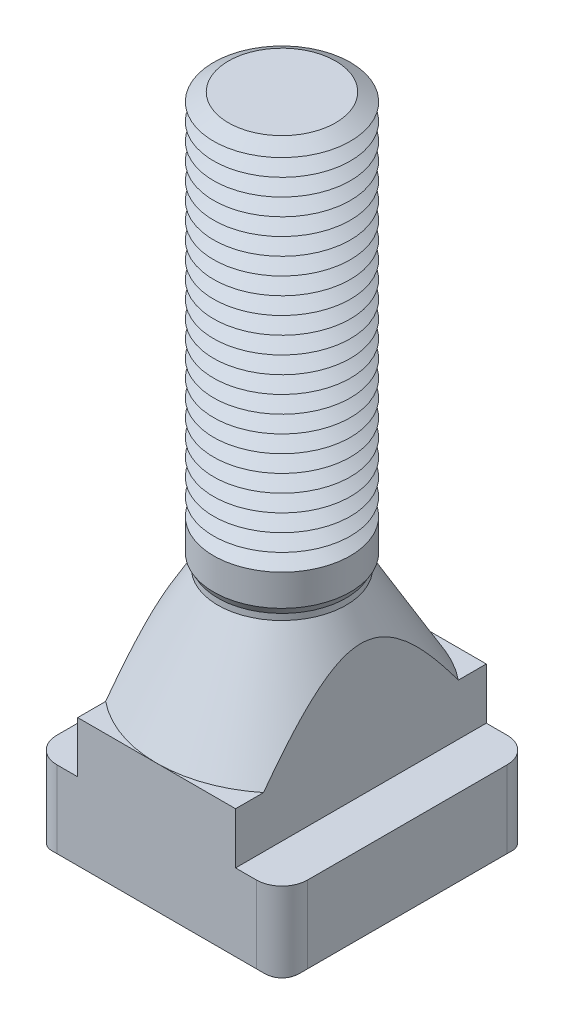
ISO-10303-21;
HEADER;
FILE_DESCRIPTION(('STEP AP214'),'2;1');
FILE_NAME('part.step','',(''),(''),'','','');
FILE_SCHEMA(('AUTOMOTIVE_DESIGN { 1 0 10303 214 1 1 1 1 }'));
ENDSEC;
DATA;
#1=APPLICATION_CONTEXT('core data for automotive mechanical design processes');
#2=APPLICATION_PROTOCOL_DEFINITION('international standard','automotive_design',2000,#1);
#3=PRODUCT_CONTEXT('',#1,'mechanical');
#4=PRODUCT('Part','Part','',(#3));
#5=PRODUCT_RELATED_PRODUCT_CATEGORY('part','',(#4));
#6=PRODUCT_DEFINITION_FORMATION('','',#4);
#7=PRODUCT_DEFINITION_CONTEXT('part definition',#1,'design');
#8=PRODUCT_DEFINITION('design','',#6,#7);
#9=PRODUCT_DEFINITION_SHAPE('','',#8);
#10=(LENGTH_UNIT() NAMED_UNIT(*) SI_UNIT(.MILLI.,.METRE.));
#11=(NAMED_UNIT(*) PLANE_ANGLE_UNIT() SI_UNIT($,.RADIAN.));
#12=(NAMED_UNIT(*) SI_UNIT($,.STERADIAN.) SOLID_ANGLE_UNIT());
#13=UNCERTAINTY_MEASURE_WITH_UNIT(LENGTH_MEASURE(1.E-05),#10,'distance_accuracy_value','');
#14=(GEOMETRIC_REPRESENTATION_CONTEXT(3) GLOBAL_UNCERTAINTY_ASSIGNED_CONTEXT((#13)) GLOBAL_UNIT_ASSIGNED_CONTEXT((#10,
#11,#12)) REPRESENTATION_CONTEXT('',''));
#15=CARTESIAN_POINT('',(0.,0.,0.));
#16=DIRECTION('',(0.,0.,1.));
#17=DIRECTION('',(1.,0.,0.));
#18=AXIS2_PLACEMENT_3D('',#15,#16,#17);
#19=CARTESIAN_POINT('',(0.,106.,0.));
#20=DIRECTION('',(0.,-1.,0.));
#21=DIRECTION('',(0.,0.,-1.));
#22=AXIS2_PLACEMENT_3D('',#19,#20,#21);
#23=CONICAL_SURFACE('',#22,9.40192378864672,1.0471975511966);
#24=CARTESIAN_POINT('',(0.,104.5,0.));
#25=DIRECTION('',(0.,-1.,0.));
#26=DIRECTION('',(0.,0.,-1.));
#27=AXIS2_PLACEMENT_3D('',#24,#25,#26);
#28=CIRCLE('',#27,12.);
#29=CARTESIAN_POINT('',(0.,104.5,-12.));
#30=VERTEX_POINT('',#29);
#31=EDGE_CURVE('E778',#30,#30,#28,.T.);
#32=ORIENTED_EDGE('',*,*,#31,.F.);
#33=EDGE_LOOP('',(#32));
#34=FACE_BOUND('',#33,.T.);
#35=CARTESIAN_POINT('',(0.,106.,0.));
#36=DIRECTION('',(0.,-1.,0.));
#37=DIRECTION('',(0.,0.,-1.));
#38=AXIS2_PLACEMENT_3D('',#35,#36,#37);
#39=CIRCLE('',#38,9.40192378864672);
#40=CARTESIAN_POINT('',(0.,106.,-9.40192378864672));
#41=VERTEX_POINT('',#40);
#42=EDGE_CURVE('E782',#41,#41,#39,.T.);
#43=ORIENTED_EDGE('',*,*,#42,.T.);
#44=EDGE_LOOP('',(#43));
#45=FACE_BOUND('',#44,.T.);
#46=ADVANCED_FACE('F39',(#34,#45),#23,.T.);
#47=CARTESIAN_POINT('',(0.,107.5,0.));
#48=DIRECTION('',(0.,1.,0.));
#49=DIRECTION('',(0.,0.,1.));
#50=AXIS2_PLACEMENT_3D('',#47,#48,#49);
#51=CONICAL_SURFACE('',#50,12.,1.0471975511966);
#52=ORIENTED_EDGE('',*,*,#42,.F.);
#53=EDGE_LOOP('',(#52));
#54=FACE_BOUND('',#53,.T.);
#55=CARTESIAN_POINT('',(0.,107.5,0.));
#56=DIRECTION('',(0.,-1.,0.));
#57=DIRECTION('',(0.,0.,-1.));
#58=AXIS2_PLACEMENT_3D('',#55,#56,#57);
#59=CIRCLE('',#58,12.);
#60=CARTESIAN_POINT('',(0.,107.5,-12.));
#61=VERTEX_POINT('',#60);
#62=EDGE_CURVE('E786',#61,#61,#59,.T.);
#63=ORIENTED_EDGE('',*,*,#62,.T.);
#64=EDGE_LOOP('',(#63));
#65=FACE_BOUND('',#64,.T.);
#66=ADVANCED_FACE('F449',(#54,#65),#51,.T.);
#67=CARTESIAN_POINT('',(4.51095758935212,118.,0.));
#68=DIRECTION('',(0.,-1.,0.));
#69=DIRECTION('',(1.,0.,0.));
#70=AXIS2_PLACEMENT_3D('',#67,#68,#69);
#71=PLANE('',#70);
#72=CARTESIAN_POINT('',(0.,118.,0.));
#73=DIRECTION('',(0.,-1.,0.));
#74=DIRECTION('',(0.,0.,-1.));
#75=AXIS2_PLACEMENT_3D('',#72,#73,#74);
#76=CIRCLE('',#75,9.40192378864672);
#77=CARTESIAN_POINT('',(0.,118.,-9.40192378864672));
#78=VERTEX_POINT('',#77);
#79=EDGE_CURVE('E667',#78,#78,#76,.T.);
#80=ORIENTED_EDGE('',*,*,#79,.F.);
#81=EDGE_LOOP('',(#80));
#82=FACE_BOUND('',#81,.T.);
#83=ADVANCED_FACE('F455',(#82),#71,.F.);
#84=CARTESIAN_POINT('',(0.,118.,0.));
#85=DIRECTION('',(0.,-1.,0.));
#86=DIRECTION('',(0.,0.,-1.));
#87=AXIS2_PLACEMENT_3D('',#84,#85,#86);
#88=CONICAL_SURFACE('',#87,9.40192378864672,1.0471975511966);
#89=CARTESIAN_POINT('',(0.,116.5,0.));
#90=DIRECTION('',(0.,-1.,0.));
#91=DIRECTION('',(0.,0.,-1.));
#92=AXIS2_PLACEMENT_3D('',#89,#90,#91);
#93=CIRCLE('',#92,12.);
#94=CARTESIAN_POINT('',(0.,116.5,-12.));
#95=VERTEX_POINT('',#94);
#96=EDGE_CURVE('E638',#95,#95,#93,.T.);
#97=ORIENTED_EDGE('',*,*,#96,.F.);
#98=EDGE_LOOP('',(#97));
#99=FACE_BOUND('',#98,.T.);
#100=ORIENTED_EDGE('',*,*,#79,.T.);
#101=EDGE_LOOP('',(#100));
#102=FACE_BOUND('',#101,.T.);
#103=ADVANCED_FACE('F483',(#99,#102),#88,.T.);
#104=CARTESIAN_POINT('',(0.,116.5,0.));
#105=DIRECTION('',(0.,1.,0.));
#106=DIRECTION('',(0.,0.,1.));
#107=AXIS2_PLACEMENT_3D('',#104,#105,#106);
#108=CONICAL_SURFACE('',#107,12.,1.0471975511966);
#109=CARTESIAN_POINT('',(0.,115.,0.));
#110=DIRECTION('',(0.,-1.,0.));
#111=DIRECTION('',(0.,0.,-1.));
#112=AXIS2_PLACEMENT_3D('',#109,#110,#111);
#113=CIRCLE('',#112,9.40192378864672);
#114=CARTESIAN_POINT('',(0.,115.,-9.40192378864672));
#115=VERTEX_POINT('',#114);
#116=EDGE_CURVE('E635',#115,#115,#113,.T.);
#117=ORIENTED_EDGE('',*,*,#116,.F.);
#118=EDGE_LOOP('',(#117));
#119=FACE_BOUND('',#118,.T.);
#120=ORIENTED_EDGE('',*,*,#96,.T.);
#121=EDGE_LOOP('',(#120));
#122=FACE_BOUND('',#121,.T.);
#123=ADVANCED_FACE('F480',(#119,#122),#108,.T.);
#124=CARTESIAN_POINT('',(0.,115.,0.));
#125=DIRECTION('',(0.,-1.,0.));
#126=DIRECTION('',(0.,0.,-1.));
#127=AXIS2_PLACEMENT_3D('',#124,#125,#126);
#128=CONICAL_SURFACE('',#127,9.40192378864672,1.0471975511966);
#129=CARTESIAN_POINT('',(0.,113.5,0.));
#130=DIRECTION('',(0.,-1.,0.));
#131=DIRECTION('',(0.,0.,-1.));
#132=AXIS2_PLACEMENT_3D('',#129,#130,#131);
#133=CIRCLE('',#132,12.);
#134=CARTESIAN_POINT('',(0.,113.5,-12.));
#135=VERTEX_POINT('',#134);
#136=EDGE_CURVE('E639',#135,#135,#133,.T.);
#137=ORIENTED_EDGE('',*,*,#136,.F.);
#138=EDGE_LOOP('',(#137));
#139=FACE_BOUND('',#138,.T.);
#140=ORIENTED_EDGE('',*,*,#116,.T.);
#141=EDGE_LOOP('',(#140));
#142=FACE_BOUND('',#141,.T.);
#143=ADVANCED_FACE('F475',(#139,#142),#128,.T.);
#144=CARTESIAN_POINT('',(0.,113.5,0.));
#145=DIRECTION('',(0.,1.,0.));
#146=DIRECTION('',(0.,0.,1.));
#147=AXIS2_PLACEMENT_3D('',#144,#145,#146);
#148=CONICAL_SURFACE('',#147,12.,1.0471975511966);
#149=CARTESIAN_POINT('',(0.,112.,0.));
#150=DIRECTION('',(0.,-1.,0.));
#151=DIRECTION('',(0.,0.,-1.));
#152=AXIS2_PLACEMENT_3D('',#149,#150,#151);
#153=CIRCLE('',#152,9.40192378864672);
#154=CARTESIAN_POINT('',(0.,112.,-9.40192378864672));
#155=VERTEX_POINT('',#154);
#156=EDGE_CURVE('E798',#155,#155,#153,.T.);
#157=ORIENTED_EDGE('',*,*,#156,.F.);
#158=EDGE_LOOP('',(#157));
#159=FACE_BOUND('',#158,.T.);
#160=ORIENTED_EDGE('',*,*,#136,.T.);
#161=EDGE_LOOP('',(#160));
#162=FACE_BOUND('',#161,.T.);
#163=ADVANCED_FACE('F472',(#159,#162),#148,.T.);
#164=CARTESIAN_POINT('',(0.,112.,0.));
#165=DIRECTION('',(0.,-1.,0.));
#166=DIRECTION('',(0.,0.,-1.));
#167=AXIS2_PLACEMENT_3D('',#164,#165,#166);
#168=CONICAL_SURFACE('',#167,9.40192378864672,1.0471975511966);
#169=CARTESIAN_POINT('',(0.,110.5,0.));
#170=DIRECTION('',(0.,-1.,0.));
#171=DIRECTION('',(0.,0.,-1.));
#172=AXIS2_PLACEMENT_3D('',#169,#170,#171);
#173=CIRCLE('',#172,12.);
#174=CARTESIAN_POINT('',(0.,110.5,-12.));
#175=VERTEX_POINT('',#174);
#176=EDGE_CURVE('E794',#175,#175,#173,.T.);
#177=ORIENTED_EDGE('',*,*,#176,.F.);
#178=EDGE_LOOP('',(#177));
#179=FACE_BOUND('',#178,.T.);
#180=ORIENTED_EDGE('',*,*,#156,.T.);
#181=EDGE_LOOP('',(#180));
#182=FACE_BOUND('',#181,.T.);
#183=ADVANCED_FACE('F466',(#179,#182),#168,.T.);
#184=CARTESIAN_POINT('',(0.,110.5,0.));
#185=DIRECTION('',(0.,1.,0.));
#186=DIRECTION('',(0.,0.,1.));
#187=AXIS2_PLACEMENT_3D('',#184,#185,#186);
#188=CONICAL_SURFACE('',#187,12.,1.0471975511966);
#189=CARTESIAN_POINT('',(0.,109.,0.));
#190=DIRECTION('',(0.,-1.,0.));
#191=DIRECTION('',(0.,0.,-1.));
#192=AXIS2_PLACEMENT_3D('',#189,#190,#191);
#193=CIRCLE('',#192,9.40192378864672);
#194=CARTESIAN_POINT('',(0.,109.,-9.40192378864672));
#195=VERTEX_POINT('',#194);
#196=EDGE_CURVE('E790',#195,#195,#193,.T.);
#197=ORIENTED_EDGE('',*,*,#196,.F.);
#198=EDGE_LOOP('',(#197));
#199=FACE_BOUND('',#198,.T.);
#200=ORIENTED_EDGE('',*,*,#176,.T.);
#201=EDGE_LOOP('',(#200));
#202=FACE_BOUND('',#201,.T.);
#203=ADVANCED_FACE('F462',(#199,#202),#188,.T.);
#204=CARTESIAN_POINT('',(0.,109.,0.));
#205=DIRECTION('',(0.,-1.,0.));
#206=DIRECTION('',(0.,0.,-1.));
#207=AXIS2_PLACEMENT_3D('',#204,#205,#206);
#208=CONICAL_SURFACE('',#207,9.40192378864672,1.0471975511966);
#209=ORIENTED_EDGE('',*,*,#62,.F.);
#210=EDGE_LOOP('',(#209));
#211=FACE_BOUND('',#210,.T.);
#212=ORIENTED_EDGE('',*,*,#196,.T.);
#213=EDGE_LOOP('',(#212));
#214=FACE_BOUND('',#213,.T.);
#215=ADVANCED_FACE('F465',(#211,#214),#208,.T.);
#216=CARTESIAN_POINT('',(0.,103.,0.));
#217=DIRECTION('',(0.,-1.,0.));
#218=DIRECTION('',(0.,0.,-1.));
#219=AXIS2_PLACEMENT_3D('',#216,#217,#218);
#220=CONICAL_SURFACE('',#219,9.40192378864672,1.0471975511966);
#221=CARTESIAN_POINT('',(0.,101.5,0.));
#222=DIRECTION('',(0.,-1.,0.));
#223=DIRECTION('',(0.,0.,-1.));
#224=AXIS2_PLACEMENT_3D('',#221,#222,#223);
#225=CIRCLE('',#224,12.);
#226=CARTESIAN_POINT('',(0.,101.5,-12.));
#227=VERTEX_POINT('',#226);
#228=EDGE_CURVE('E770',#227,#227,#225,.T.);
#229=ORIENTED_EDGE('',*,*,#228,.F.);
#230=EDGE_LOOP('',(#229));
#231=FACE_BOUND('',#230,.T.);
#232=CARTESIAN_POINT('',(0.,103.,0.));
#233=DIRECTION('',(0.,-1.,0.));
#234=DIRECTION('',(0.,0.,-1.));
#235=AXIS2_PLACEMENT_3D('',#232,#233,#234);
#236=CIRCLE('',#235,9.40192378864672);
#237=CARTESIAN_POINT('',(0.,103.,-9.40192378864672));
#238=VERTEX_POINT('',#237);
#239=EDGE_CURVE('E774',#238,#238,#236,.T.);
#240=ORIENTED_EDGE('',*,*,#239,.T.);
#241=EDGE_LOOP('',(#240));
#242=FACE_BOUND('',#241,.T.);
#243=ADVANCED_FACE('F470',(#231,#242),#220,.T.);
#244=CARTESIAN_POINT('',(0.,104.5,0.));
#245=DIRECTION('',(0.,1.,0.));
#246=DIRECTION('',(0.,0.,1.));
#247=AXIS2_PLACEMENT_3D('',#244,#245,#246);
#248=CONICAL_SURFACE('',#247,12.,1.0471975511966);
#249=ORIENTED_EDGE('',*,*,#239,.F.);
#250=EDGE_LOOP('',(#249));
#251=FACE_BOUND('',#250,.T.);
#252=ORIENTED_EDGE('',*,*,#31,.T.);
#253=EDGE_LOOP('',(#252));
#254=FACE_BOUND('',#253,.T.);
#255=ADVANCED_FACE('F1263',(#251,#254),#248,.T.);
#256=CARTESIAN_POINT('',(0.,100.,0.));
#257=DIRECTION('',(0.,-1.,0.));
#258=DIRECTION('',(0.,0.,-1.));
#259=AXIS2_PLACEMENT_3D('',#256,#257,#258);
#260=CONICAL_SURFACE('',#259,9.40192378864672,1.0471975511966);
#261=CARTESIAN_POINT('',(0.,98.5,0.));
#262=DIRECTION('',(0.,-1.,0.));
#263=DIRECTION('',(0.,0.,-1.));
#264=AXIS2_PLACEMENT_3D('',#261,#262,#263);
#265=CIRCLE('',#264,12.);
#266=CARTESIAN_POINT('',(0.,98.5,-12.));
#267=VERTEX_POINT('',#266);
#268=EDGE_CURVE('E762',#267,#267,#265,.T.);
#269=ORIENTED_EDGE('',*,*,#268,.F.);
#270=EDGE_LOOP('',(#269));
#271=FACE_BOUND('',#270,.T.);
#272=CARTESIAN_POINT('',(0.,100.,0.));
#273=DIRECTION('',(0.,-1.,0.));
#274=DIRECTION('',(0.,0.,-1.));
#275=AXIS2_PLACEMENT_3D('',#272,#273,#274);
#276=CIRCLE('',#275,9.40192378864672);
#277=CARTESIAN_POINT('',(0.,100.,-9.40192378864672));
#278=VERTEX_POINT('',#277);
#279=EDGE_CURVE('E766',#278,#278,#276,.T.);
#280=ORIENTED_EDGE('',*,*,#279,.T.);
#281=EDGE_LOOP('',(#280));
#282=FACE_BOUND('',#281,.T.);
#283=ADVANCED_FACE('F1253',(#271,#282),#260,.T.);
#284=CARTESIAN_POINT('',(0.,101.5,0.));
#285=DIRECTION('',(0.,1.,0.));
#286=DIRECTION('',(0.,0.,1.));
#287=AXIS2_PLACEMENT_3D('',#284,#285,#286);
#288=CONICAL_SURFACE('',#287,12.,1.0471975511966);
#289=ORIENTED_EDGE('',*,*,#279,.F.);
#290=EDGE_LOOP('',(#289));
#291=FACE_BOUND('',#290,.T.);
#292=ORIENTED_EDGE('',*,*,#228,.T.);
#293=EDGE_LOOP('',(#292));
#294=FACE_BOUND('',#293,.T.);
#295=ADVANCED_FACE('F1243',(#291,#294),#288,.T.);
#296=CARTESIAN_POINT('',(0.,97.,0.));
#297=DIRECTION('',(0.,-1.,0.));
#298=DIRECTION('',(0.,0.,-1.));
#299=AXIS2_PLACEMENT_3D('',#296,#297,#298);
#300=CONICAL_SURFACE('',#299,9.40192378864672,1.0471975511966);
#301=CARTESIAN_POINT('',(0.,95.5000000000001,0.));
#302=DIRECTION('',(0.,-1.,0.));
#303=DIRECTION('',(0.,0.,-1.));
#304=AXIS2_PLACEMENT_3D('',#301,#302,#303);
#305=CIRCLE('',#304,12.);
#306=CARTESIAN_POINT('',(0.,95.5000000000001,-12.));
#307=VERTEX_POINT('',#306);
#308=EDGE_CURVE('E754',#307,#307,#305,.T.);
#309=ORIENTED_EDGE('',*,*,#308,.F.);
#310=EDGE_LOOP('',(#309));
#311=FACE_BOUND('',#310,.T.);
#312=CARTESIAN_POINT('',(0.,97.,0.));
#313=DIRECTION('',(0.,-1.,0.));
#314=DIRECTION('',(0.,0.,-1.));
#315=AXIS2_PLACEMENT_3D('',#312,#313,#314);
#316=CIRCLE('',#315,9.40192378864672);
#317=CARTESIAN_POINT('',(0.,97.,-9.40192378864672));
#318=VERTEX_POINT('',#317);
#319=EDGE_CURVE('E758',#318,#318,#316,.T.);
#320=ORIENTED_EDGE('',*,*,#319,.T.);
#321=EDGE_LOOP('',(#320));
#322=FACE_BOUND('',#321,.T.);
#323=ADVANCED_FACE('F1233',(#311,#322),#300,.T.);
#324=CARTESIAN_POINT('',(0.,98.5,0.));
#325=DIRECTION('',(0.,1.,0.));
#326=DIRECTION('',(0.,0.,1.));
#327=AXIS2_PLACEMENT_3D('',#324,#325,#326);
#328=CONICAL_SURFACE('',#327,12.,1.0471975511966);
#329=ORIENTED_EDGE('',*,*,#319,.F.);
#330=EDGE_LOOP('',(#329));
#331=FACE_BOUND('',#330,.T.);
#332=ORIENTED_EDGE('',*,*,#268,.T.);
#333=EDGE_LOOP('',(#332));
#334=FACE_BOUND('',#333,.T.);
#335=ADVANCED_FACE('F1223',(#331,#334),#328,.T.);
#336=CARTESIAN_POINT('',(0.,94.0000000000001,0.));
#337=DIRECTION('',(0.,-1.,0.));
#338=DIRECTION('',(0.,0.,-1.));
#339=AXIS2_PLACEMENT_3D('',#336,#337,#338);
#340=CONICAL_SURFACE('',#339,9.40192378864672,1.0471975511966);
#341=CARTESIAN_POINT('',(0.,92.5000000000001,0.));
#342=DIRECTION('',(0.,-1.,0.));
#343=DIRECTION('',(0.,0.,-1.));
#344=AXIS2_PLACEMENT_3D('',#341,#342,#343);
#345=CIRCLE('',#344,12.);
#346=CARTESIAN_POINT('',(0.,92.5000000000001,-12.));
#347=VERTEX_POINT('',#346);
#348=EDGE_CURVE('E675',#347,#347,#345,.T.);
#349=ORIENTED_EDGE('',*,*,#348,.F.);
#350=EDGE_LOOP('',(#349));
#351=FACE_BOUND('',#350,.T.);
#352=CARTESIAN_POINT('',(0.,94.0000000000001,0.));
#353=DIRECTION('',(0.,-1.,0.));
#354=DIRECTION('',(0.,0.,-1.));
#355=AXIS2_PLACEMENT_3D('',#352,#353,#354);
#356=CIRCLE('',#355,9.40192378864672);
#357=CARTESIAN_POINT('',(0.,94.0000000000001,-9.40192378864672));
#358=VERTEX_POINT('',#357);
#359=EDGE_CURVE('E750',#358,#358,#356,.T.);
#360=ORIENTED_EDGE('',*,*,#359,.T.);
#361=EDGE_LOOP('',(#360));
#362=FACE_BOUND('',#361,.T.);
#363=ADVANCED_FACE('F1213',(#351,#362),#340,.T.);
#364=CARTESIAN_POINT('',(0.,95.5000000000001,0.));
#365=DIRECTION('',(0.,1.,0.));
#366=DIRECTION('',(0.,0.,1.));
#367=AXIS2_PLACEMENT_3D('',#364,#365,#366);
#368=CONICAL_SURFACE('',#367,12.,1.0471975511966);
#369=ORIENTED_EDGE('',*,*,#359,.F.);
#370=EDGE_LOOP('',(#369));
#371=FACE_BOUND('',#370,.T.);
#372=ORIENTED_EDGE('',*,*,#308,.T.);
#373=EDGE_LOOP('',(#372));
#374=FACE_BOUND('',#373,.T.);
#375=ADVANCED_FACE('F1203',(#371,#374),#368,.T.);
#376=CARTESIAN_POINT('',(0.,91.0000000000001,0.));
#377=DIRECTION('',(0.,-1.,0.));
#378=DIRECTION('',(0.,0.,-1.));
#379=AXIS2_PLACEMENT_3D('',#376,#377,#378);
#380=CONICAL_SURFACE('',#379,9.40192378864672,1.0471975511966);
#381=CARTESIAN_POINT('',(0.,89.5000000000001,0.));
#382=DIRECTION('',(0.,-1.,0.));
#383=DIRECTION('',(0.,0.,-1.));
#384=AXIS2_PLACEMENT_3D('',#381,#382,#383);
#385=CIRCLE('',#384,12.);
#386=CARTESIAN_POINT('',(0.,89.5000000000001,-12.));
#387=VERTEX_POINT('',#386);
#388=EDGE_CURVE('E676',#387,#387,#385,.T.);
#389=ORIENTED_EDGE('',*,*,#388,.F.);
#390=EDGE_LOOP('',(#389));
#391=FACE_BOUND('',#390,.T.);
#392=CARTESIAN_POINT('',(0.,91.0000000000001,0.));
#393=DIRECTION('',(0.,-1.,0.));
#394=DIRECTION('',(0.,0.,-1.));
#395=AXIS2_PLACEMENT_3D('',#392,#393,#394);
#396=CIRCLE('',#395,9.40192378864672);
#397=CARTESIAN_POINT('',(0.,91.0000000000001,-9.40192378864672));
#398=VERTEX_POINT('',#397);
#399=EDGE_CURVE('E672',#398,#398,#396,.T.);
#400=ORIENTED_EDGE('',*,*,#399,.T.);
#401=EDGE_LOOP('',(#400));
#402=FACE_BOUND('',#401,.T.);
#403=ADVANCED_FACE('F1193',(#391,#402),#380,.T.);
#404=CARTESIAN_POINT('',(0.,92.5000000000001,0.));
#405=DIRECTION('',(0.,1.,0.));
#406=DIRECTION('',(0.,0.,1.));
#407=AXIS2_PLACEMENT_3D('',#404,#405,#406);
#408=CONICAL_SURFACE('',#407,12.,1.0471975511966);
#409=ORIENTED_EDGE('',*,*,#399,.F.);
#410=EDGE_LOOP('',(#409));
#411=FACE_BOUND('',#410,.T.);
#412=ORIENTED_EDGE('',*,*,#348,.T.);
#413=EDGE_LOOP('',(#412));
#414=FACE_BOUND('',#413,.T.);
#415=ADVANCED_FACE('F1183',(#411,#414),#408,.T.);
#416=CARTESIAN_POINT('',(0.,88.0000000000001,0.));
#417=DIRECTION('',(0.,-1.,0.));
#418=DIRECTION('',(0.,0.,-1.));
#419=AXIS2_PLACEMENT_3D('',#416,#417,#418);
#420=CONICAL_SURFACE('',#419,9.40192378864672,1.0471975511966);
#421=CARTESIAN_POINT('',(0.,86.5,0.));
#422=DIRECTION('',(0.,-1.,0.));
#423=DIRECTION('',(0.,0.,-1.));
#424=AXIS2_PLACEMENT_3D('',#421,#422,#423);
#425=CIRCLE('',#424,12.);
#426=CARTESIAN_POINT('',(0.,86.5,-12.));
#427=VERTEX_POINT('',#426);
#428=EDGE_CURVE('E736',#427,#427,#425,.T.);
#429=ORIENTED_EDGE('',*,*,#428,.F.);
#430=EDGE_LOOP('',(#429));
#431=FACE_BOUND('',#430,.T.);
#432=CARTESIAN_POINT('',(0.,88.0000000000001,0.));
#433=DIRECTION('',(0.,-1.,0.));
#434=DIRECTION('',(0.,0.,-1.));
#435=AXIS2_PLACEMENT_3D('',#432,#433,#434);
#436=CIRCLE('',#435,9.40192378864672);
#437=CARTESIAN_POINT('',(0.,88.0000000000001,-9.40192378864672));
#438=VERTEX_POINT('',#437);
#439=EDGE_CURVE('E740',#438,#438,#436,.T.);
#440=ORIENTED_EDGE('',*,*,#439,.T.);
#441=EDGE_LOOP('',(#440));
#442=FACE_BOUND('',#441,.T.);
#443=ADVANCED_FACE('F1173',(#431,#442),#420,.T.);
#444=CARTESIAN_POINT('',(0.,89.5000000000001,0.));
#445=DIRECTION('',(0.,1.,0.));
#446=DIRECTION('',(0.,0.,1.));
#447=AXIS2_PLACEMENT_3D('',#444,#445,#446);
#448=CONICAL_SURFACE('',#447,12.,1.0471975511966);
#449=ORIENTED_EDGE('',*,*,#439,.F.);
#450=EDGE_LOOP('',(#449));
#451=FACE_BOUND('',#450,.T.);
#452=ORIENTED_EDGE('',*,*,#388,.T.);
#453=EDGE_LOOP('',(#452));
#454=FACE_BOUND('',#453,.T.);
#455=ADVANCED_FACE('F1163',(#451,#454),#448,.T.);
#456=CARTESIAN_POINT('',(0.,85.,0.));
#457=DIRECTION('',(0.,-1.,0.));
#458=DIRECTION('',(0.,0.,-1.));
#459=AXIS2_PLACEMENT_3D('',#456,#457,#458);
#460=CONICAL_SURFACE('',#459,9.40192378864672,1.0471975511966);
#461=CARTESIAN_POINT('',(0.,83.5,0.));
#462=DIRECTION('',(0.,-1.,0.));
#463=DIRECTION('',(0.,0.,-1.));
#464=AXIS2_PLACEMENT_3D('',#461,#462,#463);
#465=CIRCLE('',#464,12.);
#466=CARTESIAN_POINT('',(0.,83.5,-12.));
#467=VERTEX_POINT('',#466);
#468=EDGE_CURVE('E678',#467,#467,#465,.T.);
#469=ORIENTED_EDGE('',*,*,#468,.F.);
#470=EDGE_LOOP('',(#469));
#471=FACE_BOUND('',#470,.T.);
#472=CARTESIAN_POINT('',(0.,85.,0.));
#473=DIRECTION('',(0.,-1.,0.));
#474=DIRECTION('',(0.,0.,-1.));
#475=AXIS2_PLACEMENT_3D('',#472,#473,#474);
#476=CIRCLE('',#475,9.40192378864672);
#477=CARTESIAN_POINT('',(0.,85.,-9.40192378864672));
#478=VERTEX_POINT('',#477);
#479=EDGE_CURVE('E681',#478,#478,#476,.T.);
#480=ORIENTED_EDGE('',*,*,#479,.T.);
#481=EDGE_LOOP('',(#480));
#482=FACE_BOUND('',#481,.T.);
#483=ADVANCED_FACE('F1153',(#471,#482),#460,.T.);
#484=CARTESIAN_POINT('',(0.,86.5,0.));
#485=DIRECTION('',(0.,1.,0.));
#486=DIRECTION('',(0.,0.,1.));
#487=AXIS2_PLACEMENT_3D('',#484,#485,#486);
#488=CONICAL_SURFACE('',#487,12.,1.0471975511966);
#489=ORIENTED_EDGE('',*,*,#479,.F.);
#490=EDGE_LOOP('',(#489));
#491=FACE_BOUND('',#490,.T.);
#492=ORIENTED_EDGE('',*,*,#428,.T.);
#493=EDGE_LOOP('',(#492));
#494=FACE_BOUND('',#493,.T.);
#495=ADVANCED_FACE('F1143',(#491,#494),#488,.T.);
#496=CARTESIAN_POINT('',(0.,82.,0.));
#497=DIRECTION('',(0.,-1.,0.));
#498=DIRECTION('',(0.,0.,-1.));
#499=AXIS2_PLACEMENT_3D('',#496,#497,#498);
#500=CONICAL_SURFACE('',#499,9.40192378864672,1.0471975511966);
#501=CARTESIAN_POINT('',(0.,80.5,0.));
#502=DIRECTION('',(0.,-1.,0.));
#503=DIRECTION('',(0.,0.,-1.));
#504=AXIS2_PLACEMENT_3D('',#501,#502,#503);
#505=CIRCLE('',#504,12.);
#506=CARTESIAN_POINT('',(0.,80.5,-12.));
#507=VERTEX_POINT('',#506);
#508=EDGE_CURVE('E726',#507,#507,#505,.T.);
#509=ORIENTED_EDGE('',*,*,#508,.F.);
#510=EDGE_LOOP('',(#509));
#511=FACE_BOUND('',#510,.T.);
#512=CARTESIAN_POINT('',(0.,82.,0.));
#513=DIRECTION('',(0.,-1.,0.));
#514=DIRECTION('',(0.,0.,-1.));
#515=AXIS2_PLACEMENT_3D('',#512,#513,#514);
#516=CIRCLE('',#515,9.40192378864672);
#517=CARTESIAN_POINT('',(0.,82.,-9.40192378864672));
#518=VERTEX_POINT('',#517);
#519=EDGE_CURVE('E682',#518,#518,#516,.T.);
#520=ORIENTED_EDGE('',*,*,#519,.T.);
#521=EDGE_LOOP('',(#520));
#522=FACE_BOUND('',#521,.T.);
#523=ADVANCED_FACE('F1133',(#511,#522),#500,.T.);
#524=CARTESIAN_POINT('',(0.,83.5,0.));
#525=DIRECTION('',(0.,1.,0.));
#526=DIRECTION('',(0.,0.,1.));
#527=AXIS2_PLACEMENT_3D('',#524,#525,#526);
#528=CONICAL_SURFACE('',#527,12.,1.0471975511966);
#529=ORIENTED_EDGE('',*,*,#519,.F.);
#530=EDGE_LOOP('',(#529));
#531=FACE_BOUND('',#530,.T.);
#532=ORIENTED_EDGE('',*,*,#468,.T.);
#533=EDGE_LOOP('',(#532));
#534=FACE_BOUND('',#533,.T.);
#535=ADVANCED_FACE('F1123',(#531,#534),#528,.T.);
#536=CARTESIAN_POINT('',(0.,79.,0.));
#537=DIRECTION('',(0.,-1.,0.));
#538=DIRECTION('',(0.,0.,-1.));
#539=AXIS2_PLACEMENT_3D('',#536,#537,#538);
#540=CONICAL_SURFACE('',#539,9.40192378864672,1.0471975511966);
#541=CARTESIAN_POINT('',(0.,77.5,0.));
#542=DIRECTION('',(0.,-1.,0.));
#543=DIRECTION('',(0.,0.,-1.));
#544=AXIS2_PLACEMENT_3D('',#541,#542,#543);
#545=CIRCLE('',#544,12.);
#546=CARTESIAN_POINT('',(0.,77.5,-12.));
#547=VERTEX_POINT('',#546);
#548=EDGE_CURVE('E718',#547,#547,#545,.T.);
#549=ORIENTED_EDGE('',*,*,#548,.F.);
#550=EDGE_LOOP('',(#549));
#551=FACE_BOUND('',#550,.T.);
#552=CARTESIAN_POINT('',(0.,79.,0.));
#553=DIRECTION('',(0.,-1.,0.));
#554=DIRECTION('',(0.,0.,-1.));
#555=AXIS2_PLACEMENT_3D('',#552,#553,#554);
#556=CIRCLE('',#555,9.40192378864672);
#557=CARTESIAN_POINT('',(0.,79.,-9.40192378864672));
#558=VERTEX_POINT('',#557);
#559=EDGE_CURVE('E722',#558,#558,#556,.T.);
#560=ORIENTED_EDGE('',*,*,#559,.T.);
#561=EDGE_LOOP('',(#560));
#562=FACE_BOUND('',#561,.T.);
#563=ADVANCED_FACE('F1113',(#551,#562),#540,.T.);
#564=CARTESIAN_POINT('',(0.,80.5,0.));
#565=DIRECTION('',(0.,1.,0.));
#566=DIRECTION('',(0.,0.,1.));
#567=AXIS2_PLACEMENT_3D('',#564,#565,#566);
#568=CONICAL_SURFACE('',#567,12.,1.0471975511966);
#569=ORIENTED_EDGE('',*,*,#559,.F.);
#570=EDGE_LOOP('',(#569));
#571=FACE_BOUND('',#570,.T.);
#572=ORIENTED_EDGE('',*,*,#508,.T.);
#573=EDGE_LOOP('',(#572));
#574=FACE_BOUND('',#573,.T.);
#575=ADVANCED_FACE('F1103',(#571,#574),#568,.T.);
#576=CARTESIAN_POINT('',(0.,76.,0.));
#577=DIRECTION('',(0.,-1.,0.));
#578=DIRECTION('',(0.,0.,-1.));
#579=AXIS2_PLACEMENT_3D('',#576,#577,#578);
#580=CONICAL_SURFACE('',#579,9.40192378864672,1.0471975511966);
#581=CARTESIAN_POINT('',(0.,74.5000000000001,0.));
#582=DIRECTION('',(0.,-1.,0.));
#583=DIRECTION('',(0.,0.,-1.));
#584=AXIS2_PLACEMENT_3D('',#581,#582,#583);
#585=CIRCLE('',#584,12.);
#586=CARTESIAN_POINT('',(0.,74.5000000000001,-12.));
#587=VERTEX_POINT('',#586);
#588=EDGE_CURVE('E643',#587,#587,#585,.T.);
#589=ORIENTED_EDGE('',*,*,#588,.F.);
#590=EDGE_LOOP('',(#589));
#591=FACE_BOUND('',#590,.T.);
#592=CARTESIAN_POINT('',(0.,76.,0.));
#593=DIRECTION('',(0.,-1.,0.));
#594=DIRECTION('',(0.,0.,-1.));
#595=AXIS2_PLACEMENT_3D('',#592,#593,#594);
#596=CIRCLE('',#595,9.40192378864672);
#597=CARTESIAN_POINT('',(0.,76.,-9.40192378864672));
#598=VERTEX_POINT('',#597);
#599=EDGE_CURVE('E646',#598,#598,#596,.T.);
#600=ORIENTED_EDGE('',*,*,#599,.T.);
#601=EDGE_LOOP('',(#600));
#602=FACE_BOUND('',#601,.T.);
#603=ADVANCED_FACE('F1093',(#591,#602),#580,.T.);
#604=CARTESIAN_POINT('',(0.,77.5,0.));
#605=DIRECTION('',(0.,1.,0.));
#606=DIRECTION('',(0.,0.,1.));
#607=AXIS2_PLACEMENT_3D('',#604,#605,#606);
#608=CONICAL_SURFACE('',#607,12.,1.0471975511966);
#609=ORIENTED_EDGE('',*,*,#599,.F.);
#610=EDGE_LOOP('',(#609));
#611=FACE_BOUND('',#610,.T.);
#612=ORIENTED_EDGE('',*,*,#548,.T.);
#613=EDGE_LOOP('',(#612));
#614=FACE_BOUND('',#613,.T.);
#615=ADVANCED_FACE('F1083',(#611,#614),#608,.T.);
#616=CARTESIAN_POINT('',(0.,73.0000000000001,0.));
#617=DIRECTION('',(0.,-1.,0.));
#618=DIRECTION('',(0.,0.,-1.));
#619=AXIS2_PLACEMENT_3D('',#616,#617,#618);
#620=CONICAL_SURFACE('',#619,9.40192378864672,1.0471975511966);
#621=CARTESIAN_POINT('',(0.,71.5,0.));
#622=DIRECTION('',(0.,-1.,0.));
#623=DIRECTION('',(0.,0.,-1.));
#624=AXIS2_PLACEMENT_3D('',#621,#622,#623);
#625=CIRCLE('',#624,12.);
#626=CARTESIAN_POINT('',(0.,71.5,-12.));
#627=VERTEX_POINT('',#626);
#628=EDGE_CURVE('E657',#627,#627,#625,.T.);
#629=ORIENTED_EDGE('',*,*,#628,.F.);
#630=EDGE_LOOP('',(#629));
#631=FACE_BOUND('',#630,.T.);
#632=CARTESIAN_POINT('',(0.,73.0000000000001,0.));
#633=DIRECTION('',(0.,-1.,0.));
#634=DIRECTION('',(0.,0.,-1.));
#635=AXIS2_PLACEMENT_3D('',#632,#633,#634);
#636=CIRCLE('',#635,9.40192378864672);
#637=CARTESIAN_POINT('',(0.,73.0000000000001,-9.40192378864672));
#638=VERTEX_POINT('',#637);
#639=EDGE_CURVE('E647',#638,#638,#636,.T.);
#640=ORIENTED_EDGE('',*,*,#639,.T.);
#641=EDGE_LOOP('',(#640));
#642=FACE_BOUND('',#641,.T.);
#643=ADVANCED_FACE('F1073',(#631,#642),#620,.T.);
#644=CARTESIAN_POINT('',(0.,74.5000000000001,0.));
#645=DIRECTION('',(0.,1.,0.));
#646=DIRECTION('',(0.,0.,1.));
#647=AXIS2_PLACEMENT_3D('',#644,#645,#646);
#648=CONICAL_SURFACE('',#647,12.,1.0471975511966);
#649=ORIENTED_EDGE('',*,*,#639,.F.);
#650=EDGE_LOOP('',(#649));
#651=FACE_BOUND('',#650,.T.);
#652=ORIENTED_EDGE('',*,*,#588,.T.);
#653=EDGE_LOOP('',(#652));
#654=FACE_BOUND('',#653,.T.);
#655=ADVANCED_FACE('F1063',(#651,#654),#648,.T.);
#656=CARTESIAN_POINT('',(0.,70.,0.));
#657=DIRECTION('',(0.,-1.,0.));
#658=DIRECTION('',(0.,0.,-1.));
#659=AXIS2_PLACEMENT_3D('',#656,#657,#658);
#660=CONICAL_SURFACE('',#659,9.40192378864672,1.0471975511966);
#661=CARTESIAN_POINT('',(0.,68.5,0.));
#662=DIRECTION('',(0.,-1.,0.));
#663=DIRECTION('',(0.,0.,-1.));
#664=AXIS2_PLACEMENT_3D('',#661,#662,#663);
#665=CIRCLE('',#664,12.);
#666=CARTESIAN_POINT('',(0.,68.5,-12.));
#667=VERTEX_POINT('',#666);
#668=EDGE_CURVE('E649',#667,#667,#665,.T.);
#669=ORIENTED_EDGE('',*,*,#668,.F.);
#670=EDGE_LOOP('',(#669));
#671=FACE_BOUND('',#670,.T.);
#672=CARTESIAN_POINT('',(0.,70.,0.));
#673=DIRECTION('',(0.,-1.,0.));
#674=DIRECTION('',(0.,0.,-1.));
#675=AXIS2_PLACEMENT_3D('',#672,#673,#674);
#676=CIRCLE('',#675,9.40192378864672);
#677=CARTESIAN_POINT('',(0.,70.,-9.40192378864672));
#678=VERTEX_POINT('',#677);
#679=EDGE_CURVE('E652',#678,#678,#676,.T.);
#680=ORIENTED_EDGE('',*,*,#679,.T.);
#681=EDGE_LOOP('',(#680));
#682=FACE_BOUND('',#681,.T.);
#683=ADVANCED_FACE('F1053',(#671,#682),#660,.T.);
#684=CARTESIAN_POINT('',(0.,71.5,0.));
#685=DIRECTION('',(0.,1.,0.));
#686=DIRECTION('',(0.,0.,1.));
#687=AXIS2_PLACEMENT_3D('',#684,#685,#686);
#688=CONICAL_SURFACE('',#687,12.,1.0471975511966);
#689=ORIENTED_EDGE('',*,*,#679,.F.);
#690=EDGE_LOOP('',(#689));
#691=FACE_BOUND('',#690,.T.);
#692=ORIENTED_EDGE('',*,*,#628,.T.);
#693=EDGE_LOOP('',(#692));
#694=FACE_BOUND('',#693,.T.);
#695=ADVANCED_FACE('F1043',(#691,#694),#688,.T.);
#696=CARTESIAN_POINT('',(0.,67.,0.));
#697=DIRECTION('',(0.,-1.,0.));
#698=DIRECTION('',(0.,0.,-1.));
#699=AXIS2_PLACEMENT_3D('',#696,#697,#698);
#700=CONICAL_SURFACE('',#699,9.40192378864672,1.0471975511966);
#701=CARTESIAN_POINT('',(0.,65.5000000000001,0.));
#702=DIRECTION('',(0.,-1.,0.));
#703=DIRECTION('',(0.,0.,-1.));
#704=AXIS2_PLACEMENT_3D('',#701,#702,#703);
#705=CIRCLE('',#704,12.);
#706=CARTESIAN_POINT('',(0.,65.5000000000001,-12.));
#707=VERTEX_POINT('',#706);
#708=EDGE_CURVE('E702',#707,#707,#705,.T.);
#709=ORIENTED_EDGE('',*,*,#708,.F.);
#710=EDGE_LOOP('',(#709));
#711=FACE_BOUND('',#710,.T.);
#712=CARTESIAN_POINT('',(0.,67.,0.));
#713=DIRECTION('',(0.,-1.,0.));
#714=DIRECTION('',(0.,0.,-1.));
#715=AXIS2_PLACEMENT_3D('',#712,#713,#714);
#716=CIRCLE('',#715,9.40192378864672);
#717=CARTESIAN_POINT('',(0.,67.,-9.40192378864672));
#718=VERTEX_POINT('',#717);
#719=EDGE_CURVE('E653',#718,#718,#716,.T.);
#720=ORIENTED_EDGE('',*,*,#719,.T.);
#721=EDGE_LOOP('',(#720));
#722=FACE_BOUND('',#721,.T.);
#723=ADVANCED_FACE('F1033',(#711,#722),#700,.T.);
#724=CARTESIAN_POINT('',(0.,68.5,0.));
#725=DIRECTION('',(0.,1.,0.));
#726=DIRECTION('',(0.,0.,1.));
#727=AXIS2_PLACEMENT_3D('',#724,#725,#726);
#728=CONICAL_SURFACE('',#727,12.,1.0471975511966);
#729=ORIENTED_EDGE('',*,*,#719,.F.);
#730=EDGE_LOOP('',(#729));
#731=FACE_BOUND('',#730,.T.);
#732=ORIENTED_EDGE('',*,*,#668,.T.);
#733=EDGE_LOOP('',(#732));
#734=FACE_BOUND('',#733,.T.);
#735=ADVANCED_FACE('F1023',(#731,#734),#728,.T.);
#736=CARTESIAN_POINT('',(0.,64.0000000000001,0.));
#737=DIRECTION('',(0.,-1.,0.));
#738=DIRECTION('',(0.,0.,-1.));
#739=AXIS2_PLACEMENT_3D('',#736,#737,#738);
#740=CONICAL_SURFACE('',#739,9.40192378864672,1.0471975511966);
#741=CARTESIAN_POINT('',(0.,62.5000000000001,0.));
#742=DIRECTION('',(0.,-1.,0.));
#743=DIRECTION('',(0.,0.,-1.));
#744=AXIS2_PLACEMENT_3D('',#741,#742,#743);
#745=CIRCLE('',#744,12.);
#746=CARTESIAN_POINT('',(0.,62.5000000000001,-12.));
#747=VERTEX_POINT('',#746);
#748=EDGE_CURVE('E661',#747,#747,#745,.T.);
#749=ORIENTED_EDGE('',*,*,#748,.F.);
#750=EDGE_LOOP('',(#749));
#751=FACE_BOUND('',#750,.T.);
#752=CARTESIAN_POINT('',(0.,64.0000000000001,0.));
#753=DIRECTION('',(0.,-1.,0.));
#754=DIRECTION('',(0.,0.,-1.));
#755=AXIS2_PLACEMENT_3D('',#752,#753,#754);
#756=CIRCLE('',#755,9.40192378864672);
#757=CARTESIAN_POINT('',(0.,64.0000000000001,-9.40192378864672));
#758=VERTEX_POINT('',#757);
#759=EDGE_CURVE('E698',#758,#758,#756,.T.);
#760=ORIENTED_EDGE('',*,*,#759,.T.);
#761=EDGE_LOOP('',(#760));
#762=FACE_BOUND('',#761,.T.);
#763=ADVANCED_FACE('F1013',(#751,#762),#740,.T.);
#764=CARTESIAN_POINT('',(0.,65.5000000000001,0.));
#765=DIRECTION('',(0.,1.,0.));
#766=DIRECTION('',(0.,0.,1.));
#767=AXIS2_PLACEMENT_3D('',#764,#765,#766);
#768=CONICAL_SURFACE('',#767,12.,1.0471975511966);
#769=ORIENTED_EDGE('',*,*,#759,.F.);
#770=EDGE_LOOP('',(#769));
#771=FACE_BOUND('',#770,.T.);
#772=ORIENTED_EDGE('',*,*,#708,.T.);
#773=EDGE_LOOP('',(#772));
#774=FACE_BOUND('',#773,.T.);
#775=ADVANCED_FACE('F1003',(#771,#774),#768,.T.);
#776=CARTESIAN_POINT('',(0.,61.,0.));
#777=DIRECTION('',(0.,-1.,0.));
#778=DIRECTION('',(0.,0.,-1.));
#779=AXIS2_PLACEMENT_3D('',#776,#777,#778);
#780=CONICAL_SURFACE('',#779,9.40192378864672,1.0471975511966);
#781=CARTESIAN_POINT('',(0.,59.5,0.));
#782=DIRECTION('',(0.,-1.,0.));
#783=DIRECTION('',(0.,0.,-1.));
#784=AXIS2_PLACEMENT_3D('',#781,#782,#783);
#785=CIRCLE('',#784,12.);
#786=CARTESIAN_POINT('',(0.,59.5,-12.));
#787=VERTEX_POINT('',#786);
#788=EDGE_CURVE('E662',#787,#787,#785,.T.);
#789=ORIENTED_EDGE('',*,*,#788,.F.);
#790=EDGE_LOOP('',(#789));
#791=FACE_BOUND('',#790,.T.);
#792=CARTESIAN_POINT('',(0.,61.,0.));
#793=DIRECTION('',(0.,-1.,0.));
#794=DIRECTION('',(0.,0.,-1.));
#795=AXIS2_PLACEMENT_3D('',#792,#793,#794);
#796=CIRCLE('',#795,9.40192378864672);
#797=CARTESIAN_POINT('',(0.,61.,-9.40192378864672));
#798=VERTEX_POINT('',#797);
#799=EDGE_CURVE('E659',#798,#798,#796,.T.);
#800=ORIENTED_EDGE('',*,*,#799,.T.);
#801=EDGE_LOOP('',(#800));
#802=FACE_BOUND('',#801,.T.);
#803=ADVANCED_FACE('F993',(#791,#802),#780,.T.);
#804=CARTESIAN_POINT('',(0.,62.5000000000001,0.));
#805=DIRECTION('',(0.,1.,0.));
#806=DIRECTION('',(0.,0.,1.));
#807=AXIS2_PLACEMENT_3D('',#804,#805,#806);
#808=CONICAL_SURFACE('',#807,12.,1.0471975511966);
#809=ORIENTED_EDGE('',*,*,#799,.F.);
#810=EDGE_LOOP('',(#809));
#811=FACE_BOUND('',#810,.T.);
#812=ORIENTED_EDGE('',*,*,#748,.T.);
#813=EDGE_LOOP('',(#812));
#814=FACE_BOUND('',#813,.T.);
#815=ADVANCED_FACE('F983',(#811,#814),#808,.T.);
#816=CARTESIAN_POINT('',(0.,58.,0.));
#817=DIRECTION('',(0.,-1.,0.));
#818=DIRECTION('',(0.,0.,-1.));
#819=AXIS2_PLACEMENT_3D('',#816,#817,#818);
#820=CONICAL_SURFACE('',#819,9.40192378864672,1.0471975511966);
#821=CARTESIAN_POINT('',(0.,56.5,0.));
#822=DIRECTION('',(0.,-1.,0.));
#823=DIRECTION('',(0.,0.,-1.));
#824=AXIS2_PLACEMENT_3D('',#821,#822,#823);
#825=CIRCLE('',#824,12.);
#826=CARTESIAN_POINT('',(0.,56.5,-12.));
#827=VERTEX_POINT('',#826);
#828=EDGE_CURVE('E1531',#827,#827,#825,.T.);
#829=ORIENTED_EDGE('',*,*,#828,.F.);
#830=EDGE_LOOP('',(#829));
#831=FACE_BOUND('',#830,.T.);
#832=CARTESIAN_POINT('',(0.,58.,0.));
#833=DIRECTION('',(0.,-1.,0.));
#834=DIRECTION('',(0.,0.,-1.));
#835=AXIS2_PLACEMENT_3D('',#832,#833,#834);
#836=CIRCLE('',#835,9.40192378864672);
#837=CARTESIAN_POINT('',(0.,58.,-9.40192378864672));
#838=VERTEX_POINT('',#837);
#839=EDGE_CURVE('E685',#838,#838,#836,.T.);
#840=ORIENTED_EDGE('',*,*,#839,.T.);
#841=EDGE_LOOP('',(#840));
#842=FACE_BOUND('',#841,.T.);
#843=ADVANCED_FACE('F973',(#831,#842),#820,.T.);
#844=CARTESIAN_POINT('',(0.,59.5,0.));
#845=DIRECTION('',(0.,1.,0.));
#846=DIRECTION('',(0.,0.,1.));
#847=AXIS2_PLACEMENT_3D('',#844,#845,#846);
#848=CONICAL_SURFACE('',#847,12.,1.0471975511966);
#849=ORIENTED_EDGE('',*,*,#839,.F.);
#850=EDGE_LOOP('',(#849));
#851=FACE_BOUND('',#850,.T.);
#852=ORIENTED_EDGE('',*,*,#788,.T.);
#853=EDGE_LOOP('',(#852));
#854=FACE_BOUND('',#853,.T.);
#855=ADVANCED_FACE('F963',(#851,#854),#848,.T.);
#856=CARTESIAN_POINT('',(0.,55.,0.));
#857=DIRECTION('',(0.,-1.,0.));
#858=DIRECTION('',(0.,0.,-1.));
#859=AXIS2_PLACEMENT_3D('',#856,#857,#858);
#860=CONICAL_SURFACE('',#859,9.40192378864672,1.0471975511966);
#861=CARTESIAN_POINT('',(0.,53.5,0.));
#862=DIRECTION('',(0.,-1.,0.));
#863=DIRECTION('',(0.,0.,-1.));
#864=AXIS2_PLACEMENT_3D('',#861,#862,#863);
#865=CIRCLE('',#864,12.);
#866=CARTESIAN_POINT('',(0.,53.5,-12.));
#867=VERTEX_POINT('',#866);
#868=EDGE_CURVE('E691',#867,#867,#865,.T.);
#869=ORIENTED_EDGE('',*,*,#868,.F.);
#870=EDGE_LOOP('',(#869));
#871=FACE_BOUND('',#870,.T.);
#872=CARTESIAN_POINT('',(0.,55.,0.));
#873=DIRECTION('',(0.,-1.,0.));
#874=DIRECTION('',(0.,0.,-1.));
#875=AXIS2_PLACEMENT_3D('',#872,#873,#874);
#876=CIRCLE('',#875,9.40192378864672);
#877=CARTESIAN_POINT('',(0.,55.,-9.40192378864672));
#878=VERTEX_POINT('',#877);
#879=EDGE_CURVE('E1535',#878,#878,#876,.T.);
#880=ORIENTED_EDGE('',*,*,#879,.T.);
#881=EDGE_LOOP('',(#880));
#882=FACE_BOUND('',#881,.T.);
#883=ADVANCED_FACE('F567',(#871,#882),#860,.T.);
#884=CARTESIAN_POINT('',(0.,56.5,0.));
#885=DIRECTION('',(0.,1.,0.));
#886=DIRECTION('',(0.,0.,1.));
#887=AXIS2_PLACEMENT_3D('',#884,#885,#886);
#888=CONICAL_SURFACE('',#887,12.,1.0471975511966);
#889=ORIENTED_EDGE('',*,*,#879,.F.);
#890=EDGE_LOOP('',(#889));
#891=FACE_BOUND('',#890,.T.);
#892=ORIENTED_EDGE('',*,*,#828,.T.);
#893=EDGE_LOOP('',(#892));
#894=FACE_BOUND('',#893,.T.);
#895=ADVANCED_FACE('F562',(#891,#894),#888,.T.);
#896=CARTESIAN_POINT('',(-19.8786796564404,8.74264068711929,-19.8786796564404));
#897=DIRECTION('',(-0.577350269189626,0.577350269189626,-0.577350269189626));
#898=DIRECTION('',(-0.707106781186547,0.,0.707106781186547));
#899=AXIS2_PLACEMENT_3D('',#896,#897,#898);
#900=CYLINDRICAL_SURFACE('',#899,4.5);
#901=CARTESIAN_POINT('',(-11.1360389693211,0.,-11.1360389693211));
#902=DIRECTION('',(0.,1.,0.));
#903=DIRECTION('',(-0.707106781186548,0.,-0.707106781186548));
#904=AXIS2_PLACEMENT_3D('',#901,#902,#903);
#905=ELLIPSE('',#904,7.79422863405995,4.5);
#906=CARTESIAN_POINT('',(-17.5,0.,-14.3180194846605));
#907=VERTEX_POINT('',#906);
#908=CARTESIAN_POINT('',(-14.3180194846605,0.,-17.5));
#909=VERTEX_POINT('',#908);
#910=EDGE_CURVE('E326',#907,#909,#905,.F.);
#911=ORIENTED_EDGE('',*,*,#910,.F.);
#912=DIRECTION('',(0.577350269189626,-0.577350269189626,0.577350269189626));
#913=VECTOR('',#912,1.);
#914=CARTESIAN_POINT('',(-8.39399350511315,-9.10600649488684,-5.2120129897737));
#915=LINE('',#914,#913);
#916=CARTESIAN_POINT('',(-21.8466662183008,4.34666621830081,-18.6646857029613));
#917=VERTEX_POINT('',#916);
#918=EDGE_CURVE('E366',#917,#907,#915,.T.);
#919=ORIENTED_EDGE('',*,*,#918,.F.);
#920=CARTESIAN_POINT('',(-17.5,6.36396103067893,-17.5));
#921=DIRECTION('',(0.325057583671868,-0.888073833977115,0.325057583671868));
#922=DIRECTION('',(-0.627963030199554,-0.459700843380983,-0.627963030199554));
#923=AXIS2_PLACEMENT_3D('',#920,#921,#922);
#924=ELLIPSE('',#923,5.06714625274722,4.5);
#925=CARTESIAN_POINT('',(-18.6646857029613,4.34666621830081,-21.8466662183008));
#926=VERTEX_POINT('',#925);
#927=EDGE_CURVE('E264',#917,#926,#924,.T.);
#928=ORIENTED_EDGE('',*,*,#927,.T.);
#929=DIRECTION('',(0.577350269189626,-0.577350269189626,0.577350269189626));
#930=VECTOR('',#929,1.);
#931=CARTESIAN_POINT('',(-19.8786796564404,5.56066017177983,-23.0606601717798));
#932=LINE('',#931,#930);
#933=EDGE_CURVE('E359',#909,#926,#932,.F.);
#934=ORIENTED_EDGE('',*,*,#933,.F.);
#935=EDGE_LOOP('',(#911,#919,#928,#934));
#936=FACE_BOUND('',#935,.T.);
#937=ADVANCED_FACE('F551',(#936),#900,.T.);
#938=CARTESIAN_POINT('',(5.21201298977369,-5.92402597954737,-5.21201298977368));
#939=DIRECTION('',(0.577350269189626,0.577350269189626,-0.577350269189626));
#940=DIRECTION('',(-0.707106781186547,0.,-0.707106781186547));
#941=AXIS2_PLACEMENT_3D('',#938,#939,#940);
#942=CYLINDRICAL_SURFACE('',#941,4.5);
#943=CARTESIAN_POINT('',(11.1360389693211,0.,-11.1360389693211));
#944=DIRECTION('',(0.,1.,0.));
#945=DIRECTION('',(0.707106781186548,0.,-0.707106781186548));
#946=AXIS2_PLACEMENT_3D('',#943,#944,#945);
#947=ELLIPSE('',#946,7.79422863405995,4.5);
#948=CARTESIAN_POINT('',(14.3180194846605,0.,-17.5));
#949=VERTEX_POINT('',#948);
#950=CARTESIAN_POINT('',(17.5,0.,-14.3180194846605));
#951=VERTEX_POINT('',#950);
#952=EDGE_CURVE('E332',#949,#951,#947,.F.);
#953=ORIENTED_EDGE('',*,*,#952,.F.);
#954=DIRECTION('',(-0.577350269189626,-0.577350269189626,0.577350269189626));
#955=VECTOR('',#954,1.);
#956=CARTESIAN_POINT('',(5.21201298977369,-9.10600649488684,-8.39399350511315));
#957=LINE('',#956,#955);
#958=CARTESIAN_POINT('',(18.6646857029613,4.34666621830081,-21.8466662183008));
#959=VERTEX_POINT('',#958);
#960=EDGE_CURVE('E353',#959,#949,#957,.T.);
#961=ORIENTED_EDGE('',*,*,#960,.F.);
#962=CARTESIAN_POINT('',(17.5,6.36396103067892,-17.5));
#963=DIRECTION('',(-0.325057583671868,-0.888073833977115,0.325057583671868));
#964=DIRECTION('',(0.627963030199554,-0.459700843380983,-0.627963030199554));
#965=AXIS2_PLACEMENT_3D('',#962,#963,#964);
#966=ELLIPSE('',#965,5.06714625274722,4.5);
#967=CARTESIAN_POINT('',(21.8466662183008,4.34666621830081,-18.6646857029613));
#968=VERTEX_POINT('',#967);
#969=EDGE_CURVE('E407',#959,#968,#966,.T.);
#970=ORIENTED_EDGE('',*,*,#969,.T.);
#971=DIRECTION('',(-0.577350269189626,-0.577350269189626,0.577350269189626));
#972=VECTOR('',#971,1.);
#973=CARTESIAN_POINT('',(8.39399350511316,-9.10600649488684,-5.21201298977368));
#974=LINE('',#973,#972);
#975=EDGE_CURVE('E322',#951,#968,#974,.F.);
#976=ORIENTED_EDGE('',*,*,#975,.F.);
#977=EDGE_LOOP('',(#953,#961,#970,#976));
#978=FACE_BOUND('',#977,.T.);
#979=ADVANCED_FACE('F547',(#978),#942,.T.);
#980=CARTESIAN_POINT('',(22.,0.,-22.));
#981=DIRECTION('',(0.,1.,0.));
#982=DIRECTION('',(0.,0.,1.));
#983=AXIS2_PLACEMENT_3D('',#980,#981,#982);
#984=PLANE('',#983);
#985=DIRECTION('',(0.,0.,1.));
#986=VECTOR('',#985,1.);
#987=CARTESIAN_POINT('',(17.5,0.,-22.));
#988=LINE('',#987,#986);
#989=CARTESIAN_POINT('',(17.5,0.,14.3180194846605));
#990=VERTEX_POINT('',#989);
#991=EDGE_CURVE('E296',#951,#990,#988,.T.);
#992=ORIENTED_EDGE('',*,*,#991,.T.);
#993=CARTESIAN_POINT('',(11.1360389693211,0.,11.1360389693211));
#994=DIRECTION('',(0.,1.,0.));
#995=DIRECTION('',(-0.707106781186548,0.,-0.707106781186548));
#996=AXIS2_PLACEMENT_3D('',#993,#994,#995);
#997=ELLIPSE('',#996,7.79422863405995,4.5);
#998=CARTESIAN_POINT('',(14.3180194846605,0.,17.5));
#999=VERTEX_POINT('',#998);
#1000=EDGE_CURVE('E335',#990,#999,#997,.F.);
#1001=ORIENTED_EDGE('',*,*,#1000,.T.);
#1002=DIRECTION('',(-1.,0.,0.));
#1003=VECTOR('',#1002,1.);
#1004=CARTESIAN_POINT('',(22.,0.,17.5));
#1005=LINE('',#1004,#1003);
#1006=CARTESIAN_POINT('',(-14.3180194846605,0.,17.5));
#1007=VERTEX_POINT('',#1006);
#1008=EDGE_CURVE('E283',#999,#1007,#1005,.T.);
#1009=ORIENTED_EDGE('',*,*,#1008,.T.);
#1010=CARTESIAN_POINT('',(-11.1360389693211,0.,11.1360389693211));
#1011=DIRECTION('',(0.,1.,0.));
#1012=DIRECTION('',(0.707106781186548,0.,-0.707106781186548));
#1013=AXIS2_PLACEMENT_3D('',#1010,#1011,#1012);
#1014=ELLIPSE('',#1013,7.79422863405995,4.5);
#1015=CARTESIAN_POINT('',(-17.5,0.,14.3180194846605));
#1016=VERTEX_POINT('',#1015);
#1017=EDGE_CURVE('E329',#1007,#1016,#1014,.F.);
#1018=ORIENTED_EDGE('',*,*,#1017,.T.);
#1019=DIRECTION('',(0.,0.,-1.));
#1020=VECTOR('',#1019,1.);
#1021=CARTESIAN_POINT('',(-17.5,0.,-22.));
#1022=LINE('',#1021,#1020);
#1023=EDGE_CURVE('E288',#1016,#907,#1022,.T.);
#1024=ORIENTED_EDGE('',*,*,#1023,.T.);
#1025=ORIENTED_EDGE('',*,*,#910,.T.);
#1026=DIRECTION('',(1.,0.,0.));
#1027=VECTOR('',#1026,1.);
#1028=CARTESIAN_POINT('',(22.,0.,-17.5));
#1029=LINE('',#1028,#1027);
#1030=EDGE_CURVE('E292',#909,#949,#1029,.T.);
#1031=ORIENTED_EDGE('',*,*,#1030,.T.);
#1032=ORIENTED_EDGE('',*,*,#952,.T.);
#1033=EDGE_LOOP('',(#992,#1001,#1009,#1018,#1024,#1025,#1031,#1032));
#1034=FACE_BOUND('',#1033,.T.);
#1035=ADVANCED_FACE('F550',(#1034),#984,.F.);
#1036=CARTESIAN_POINT('',(-19.8786796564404,8.74264068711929,19.8786796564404));
#1037=DIRECTION('',(0.577350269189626,-0.577350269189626,-0.577350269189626));
#1038=DIRECTION('',(-0.707106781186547,0.,-0.707106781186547));
#1039=AXIS2_PLACEMENT_3D('',#1036,#1037,#1038);
#1040=CYLINDRICAL_SURFACE('',#1039,4.5);
#1041=CARTESIAN_POINT('',(-17.5,6.36396103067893,17.5));
#1042=DIRECTION('',(0.325057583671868,-0.888073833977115,-0.325057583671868));
#1043=DIRECTION('',(-0.627963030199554,-0.459700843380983,0.627963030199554));
#1044=AXIS2_PLACEMENT_3D('',#1041,#1042,#1043);
#1045=ELLIPSE('',#1044,5.06714625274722,4.5);
#1046=CARTESIAN_POINT('',(-18.6646857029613,4.34666621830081,21.8466662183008));
#1047=VERTEX_POINT('',#1046);
#1048=CARTESIAN_POINT('',(-21.8466662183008,4.34666621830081,18.6646857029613));
#1049=VERTEX_POINT('',#1048);
#1050=EDGE_CURVE('E410',#1047,#1049,#1045,.T.);
#1051=ORIENTED_EDGE('',*,*,#1050,.T.);
#1052=DIRECTION('',(-0.577350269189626,0.577350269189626,0.577350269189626));
#1053=VECTOR('',#1052,1.);
#1054=CARTESIAN_POINT('',(-23.0606601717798,5.56066017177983,19.8786796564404));
#1055=LINE('',#1054,#1053);
#1056=EDGE_CURVE('E372',#1016,#1049,#1055,.T.);
#1057=ORIENTED_EDGE('',*,*,#1056,.F.);
#1058=ORIENTED_EDGE('',*,*,#1017,.F.);
#1059=DIRECTION('',(-0.577350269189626,0.577350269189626,0.577350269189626));
#1060=VECTOR('',#1059,1.);
#1061=CARTESIAN_POINT('',(-19.8786796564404,5.56066017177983,23.0606601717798));
#1062=LINE('',#1061,#1060);
#1063=EDGE_CURVE('E346',#1047,#1007,#1062,.F.);
#1064=ORIENTED_EDGE('',*,*,#1063,.F.);
#1065=EDGE_LOOP('',(#1051,#1057,#1058,#1064));
#1066=FACE_BOUND('',#1065,.T.);
#1067=ADVANCED_FACE('F542',(#1066),#1040,.T.);
#1068=CARTESIAN_POINT('',(-22.,4.5,22.));
#1069=DIRECTION('',(0.707106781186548,0.707106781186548,0.));
#1070=DIRECTION('',(-0.707106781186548,0.707106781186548,0.));
#1071=AXIS2_PLACEMENT_3D('',#1068,#1069,#1070);
#1072=PLANE('',#1071);
#1073=ORIENTED_EDGE('',*,*,#1023,.F.);
#1074=ORIENTED_EDGE('',*,*,#1056,.T.);
#1075=CARTESIAN_POINT('',(-17.5,0.,17.5));
#1076=DIRECTION('',(0.707106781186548,0.707106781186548,0.));
#1077=DIRECTION('',(0.707106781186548,-0.707106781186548,0.));
#1078=AXIS2_PLACEMENT_3D('',#1075,#1076,#1077);
#1079=ELLIPSE('',#1078,6.36396103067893,4.5);
#1080=CARTESIAN_POINT('',(-22.,4.5,17.5));
#1081=VERTEX_POINT('',#1080);
#1082=EDGE_CURVE('E369',#1049,#1081,#1079,.F.);
#1083=ORIENTED_EDGE('',*,*,#1082,.T.);
#1084=DIRECTION('',(0.,0.,1.));
#1085=VECTOR('',#1084,1.);
#1086=CARTESIAN_POINT('',(-22.,4.5,22.));
#1087=LINE('',#1086,#1085);
#1088=CARTESIAN_POINT('',(-22.,4.5,-17.5));
#1089=VERTEX_POINT('',#1088);
#1090=EDGE_CURVE('E304',#1089,#1081,#1087,.T.);
#1091=ORIENTED_EDGE('',*,*,#1090,.F.);
#1092=CARTESIAN_POINT('',(-17.5,0.,-17.5));
#1093=DIRECTION('',(0.707106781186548,0.707106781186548,0.));
#1094=DIRECTION('',(0.707106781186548,-0.707106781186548,0.));
#1095=AXIS2_PLACEMENT_3D('',#1092,#1093,#1094);
#1096=ELLIPSE('',#1095,6.36396103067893,4.5);
#1097=EDGE_CURVE('E363',#1089,#917,#1096,.F.);
#1098=ORIENTED_EDGE('',*,*,#1097,.T.);
#1099=ORIENTED_EDGE('',*,*,#918,.T.);
#1100=EDGE_LOOP('',(#1073,#1074,#1083,#1091,#1098,#1099));
#1101=FACE_BOUND('',#1100,.T.);
#1102=ADVANCED_FACE('F529',(#1101),#1072,.F.);
#1103=CARTESIAN_POINT('',(22.,4.5,22.));
#1104=DIRECTION('',(-0.707106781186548,0.707106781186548,0.));
#1105=DIRECTION('',(-0.707106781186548,-0.707106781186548,0.));
#1106=AXIS2_PLACEMENT_3D('',#1103,#1104,#1105);
#1107=PLANE('',#1106);
#1108=ORIENTED_EDGE('',*,*,#991,.F.);
#1109=ORIENTED_EDGE('',*,*,#975,.T.);
#1110=CARTESIAN_POINT('',(17.5,0.,-17.5));
#1111=DIRECTION('',(-0.707106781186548,0.707106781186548,0.));
#1112=DIRECTION('',(-0.707106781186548,-0.707106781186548,0.));
#1113=AXIS2_PLACEMENT_3D('',#1110,#1111,#1112);
#1114=ELLIPSE('',#1113,6.36396103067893,4.5);
#1115=CARTESIAN_POINT('',(22.,4.5,-17.5));
#1116=VERTEX_POINT('',#1115);
#1117=EDGE_CURVE('E319',#968,#1116,#1114,.F.);
#1118=ORIENTED_EDGE('',*,*,#1117,.T.);
#1119=DIRECTION('',(0.,0.,-1.));
#1120=VECTOR('',#1119,1.);
#1121=CARTESIAN_POINT('',(22.,4.5,22.));
#1122=LINE('',#1121,#1120);
#1123=CARTESIAN_POINT('',(22.,4.5,17.5));
#1124=VERTEX_POINT('',#1123);
#1125=EDGE_CURVE('E279',#1124,#1116,#1122,.T.);
#1126=ORIENTED_EDGE('',*,*,#1125,.F.);
#1127=CARTESIAN_POINT('',(17.5,0.,17.5));
#1128=DIRECTION('',(-0.707106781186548,0.707106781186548,0.));
#1129=DIRECTION('',(-0.707106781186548,-0.707106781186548,0.));
#1130=AXIS2_PLACEMENT_3D('',#1127,#1128,#1129);
#1131=ELLIPSE('',#1130,6.36396103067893,4.5);
#1132=CARTESIAN_POINT('',(21.8466662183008,4.34666621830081,18.6646857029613));
#1133=VERTEX_POINT('',#1132);
#1134=EDGE_CURVE('E312',#1124,#1133,#1131,.F.);
#1135=ORIENTED_EDGE('',*,*,#1134,.T.);
#1136=DIRECTION('',(0.577350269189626,0.577350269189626,0.577350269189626));
#1137=VECTOR('',#1136,1.);
#1138=CARTESIAN_POINT('',(23.0606601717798,5.56066017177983,19.8786796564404));
#1139=LINE('',#1138,#1137);
#1140=EDGE_CURVE('E315',#1133,#990,#1139,.F.);
#1141=ORIENTED_EDGE('',*,*,#1140,.T.);
#1142=EDGE_LOOP('',(#1108,#1109,#1118,#1126,#1135,#1141));
#1143=FACE_BOUND('',#1142,.T.);
#1144=ADVANCED_FACE('F526',(#1143),#1107,.F.);
#1145=CARTESIAN_POINT('',(19.8786796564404,8.74264068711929,19.8786796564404));
#1146=DIRECTION('',(-0.577350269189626,-0.577350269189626,-0.577350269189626));
#1147=DIRECTION('',(-0.707106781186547,0.,0.707106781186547));
#1148=AXIS2_PLACEMENT_3D('',#1145,#1146,#1147);
#1149=CYLINDRICAL_SURFACE('',#1148,4.5);
#1150=CARTESIAN_POINT('',(17.5,6.36396103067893,17.5));
#1151=DIRECTION('',(-0.325057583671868,-0.888073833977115,-0.325057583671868));
#1152=DIRECTION('',(0.627963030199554,-0.459700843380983,0.627963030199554));
#1153=AXIS2_PLACEMENT_3D('',#1150,#1151,#1152);
#1154=ELLIPSE('',#1153,5.06714625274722,4.5);
#1155=CARTESIAN_POINT('',(18.6646857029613,4.34666621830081,21.8466662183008));
#1156=VERTEX_POINT('',#1155);
#1157=EDGE_CURVE('E269',#1133,#1156,#1154,.T.);
#1158=ORIENTED_EDGE('',*,*,#1157,.T.);
#1159=DIRECTION('',(0.577350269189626,0.577350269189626,0.577350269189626));
#1160=VECTOR('',#1159,1.);
#1161=CARTESIAN_POINT('',(5.21201298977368,-9.10600649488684,8.39399350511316));
#1162=LINE('',#1161,#1160);
#1163=EDGE_CURVE('E340',#999,#1156,#1162,.T.);
#1164=ORIENTED_EDGE('',*,*,#1163,.F.);
#1165=ORIENTED_EDGE('',*,*,#1000,.F.);
#1166=ORIENTED_EDGE('',*,*,#1140,.F.);
#1167=EDGE_LOOP('',(#1158,#1164,#1165,#1166));
#1168=FACE_BOUND('',#1167,.T.);
#1169=ADVANCED_FACE('F523',(#1168),#1149,.T.);
#1170=CARTESIAN_POINT('',(-22.,27.,22.));
#1171=DIRECTION('',(1.,0.,0.));
#1172=DIRECTION('',(0.,0.,-1.));
#1173=AXIS2_PLACEMENT_3D('',#1170,#1171,#1172);
#1174=PLANE('',#1173);
#1175=DIRECTION('',(0.,-1.,0.));
#1176=VECTOR('',#1175,1.);
#1177=CARTESIAN_POINT('',(-22.,27.,17.5));
#1178=LINE('',#1177,#1176);
#1179=CARTESIAN_POINT('',(-22.,18.,17.5));
#1180=VERTEX_POINT('',#1179);
#1181=EDGE_CURVE('E385',#1081,#1180,#1178,.F.);
#1182=ORIENTED_EDGE('',*,*,#1181,.T.);
#1183=DIRECTION('',(0.,0.,-1.));
#1184=VECTOR('',#1183,1.);
#1185=CARTESIAN_POINT('',(-22.,18.,22.));
#1186=LINE('',#1185,#1184);
#1187=CARTESIAN_POINT('',(-22.,18.,-17.5));
#1188=VERTEX_POINT('',#1187);
#1189=EDGE_CURVE('E231',#1180,#1188,#1186,.T.);
#1190=ORIENTED_EDGE('',*,*,#1189,.T.);
#1191=DIRECTION('',(0.,-1.,0.));
#1192=VECTOR('',#1191,1.);
#1193=CARTESIAN_POINT('',(-22.,27.,-17.5));
#1194=LINE('',#1193,#1192);
#1195=EDGE_CURVE('E382',#1188,#1089,#1194,.T.);
#1196=ORIENTED_EDGE('',*,*,#1195,.T.);
#1197=ORIENTED_EDGE('',*,*,#1090,.T.);
#1198=EDGE_LOOP('',(#1182,#1190,#1196,#1197));
#1199=FACE_BOUND('',#1198,.T.);
#1200=ADVANCED_FACE('F521',(#1199),#1174,.F.);
#1201=CARTESIAN_POINT('',(-17.5,27.,-17.5));
#1202=DIRECTION('',(0.,-1.,0.));
#1203=DIRECTION('',(0.,0.,-1.));
#1204=AXIS2_PLACEMENT_3D('',#1201,#1202,#1203);
#1205=CYLINDRICAL_SURFACE('',#1204,4.5);
#1206=CARTESIAN_POINT('',(-17.5,18.,-17.5));
#1207=DIRECTION('',(0.,-1.,0.));
#1208=DIRECTION('',(0.,0.,-1.));
#1209=AXIS2_PLACEMENT_3D('',#1206,#1207,#1208);
#1210=CIRCLE('',#1209,4.5);
#1211=CARTESIAN_POINT('',(-17.5,18.,-22.));
#1212=VERTEX_POINT('',#1211);
#1213=EDGE_CURVE('E403',#1212,#1188,#1210,.F.);
#1214=ORIENTED_EDGE('',*,*,#1213,.F.);
#1215=DIRECTION('',(0.,-1.,0.));
#1216=VECTOR('',#1215,1.);
#1217=CARTESIAN_POINT('',(-17.5,27.,-22.));
#1218=LINE('',#1217,#1216);
#1219=CARTESIAN_POINT('',(-17.5,4.5,-22.));
#1220=VERTEX_POINT('',#1219);
#1221=EDGE_CURVE('E392',#1220,#1212,#1218,.F.);
#1222=ORIENTED_EDGE('',*,*,#1221,.F.);
#1223=CARTESIAN_POINT('',(-17.5,0.,-17.5));
#1224=DIRECTION('',(0.,0.707106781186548,0.707106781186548));
#1225=DIRECTION('',(0.,-0.707106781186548,0.707106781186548));
#1226=AXIS2_PLACEMENT_3D('',#1223,#1224,#1225);
#1227=ELLIPSE('',#1226,6.36396103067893,4.5);
#1228=EDGE_CURVE('E356',#926,#1220,#1227,.F.);
#1229=ORIENTED_EDGE('',*,*,#1228,.F.);
#1230=ORIENTED_EDGE('',*,*,#927,.F.);
#1231=ORIENTED_EDGE('',*,*,#1097,.F.);
#1232=ORIENTED_EDGE('',*,*,#1195,.F.);
#1233=EDGE_LOOP('',(#1214,#1222,#1229,#1230,#1231,#1232));
#1234=FACE_BOUND('',#1233,.T.);
#1235=ADVANCED_FACE('F41',(#1234),#1205,.T.);
#1236=CARTESIAN_POINT('',(-22.,4.5,-22.));
#1237=DIRECTION('',(0.,0.707106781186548,0.707106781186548));
#1238=DIRECTION('',(0.,-0.707106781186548,0.707106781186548));
#1239=AXIS2_PLACEMENT_3D('',#1236,#1237,#1238);
#1240=PLANE('',#1239);
#1241=ORIENTED_EDGE('',*,*,#1030,.F.);
#1242=ORIENTED_EDGE('',*,*,#933,.T.);
#1243=ORIENTED_EDGE('',*,*,#1228,.T.);
#1244=DIRECTION('',(-1.,0.,0.));
#1245=VECTOR('',#1244,1.);
#1246=CARTESIAN_POINT('',(-22.,4.5,-22.));
#1247=LINE('',#1246,#1245);
#1248=CARTESIAN_POINT('',(17.5,4.5,-22.));
#1249=VERTEX_POINT('',#1248);
#1250=EDGE_CURVE('E300',#1249,#1220,#1247,.T.);
#1251=ORIENTED_EDGE('',*,*,#1250,.F.);
#1252=CARTESIAN_POINT('',(17.5,0.,-17.5));
#1253=DIRECTION('',(0.,0.707106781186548,0.707106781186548));
#1254=DIRECTION('',(0.,-0.707106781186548,0.707106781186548));
#1255=AXIS2_PLACEMENT_3D('',#1252,#1253,#1254);
#1256=ELLIPSE('',#1255,6.36396103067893,4.5);
#1257=EDGE_CURVE('E350',#1249,#959,#1256,.F.);
#1258=ORIENTED_EDGE('',*,*,#1257,.T.);
#1259=ORIENTED_EDGE('',*,*,#960,.T.);
#1260=EDGE_LOOP('',(#1241,#1242,#1243,#1251,#1258,#1259));
#1261=FACE_BOUND('',#1260,.T.);
#1262=ADVANCED_FACE('F531',(#1261),#1240,.F.);
#1263=CARTESIAN_POINT('',(17.5,27.,-17.5));
#1264=DIRECTION('',(0.,-1.,0.));
#1265=DIRECTION('',(0.,0.,-1.));
#1266=AXIS2_PLACEMENT_3D('',#1263,#1264,#1265);
#1267=CYLINDRICAL_SURFACE('',#1266,4.5);
#1268=CARTESIAN_POINT('',(17.5,18.,-17.5));
#1269=DIRECTION('',(0.,-1.,0.));
#1270=DIRECTION('',(0.,0.,-1.));
#1271=AXIS2_PLACEMENT_3D('',#1268,#1269,#1270);
#1272=CIRCLE('',#1271,4.5);
#1273=CARTESIAN_POINT('',(22.,18.,-17.5));
#1274=VERTEX_POINT('',#1273);
#1275=CARTESIAN_POINT('',(17.5,18.,-22.));
#1276=VERTEX_POINT('',#1275);
#1277=EDGE_CURVE('E53',#1274,#1276,#1272,.F.);
#1278=ORIENTED_EDGE('',*,*,#1277,.F.);
#1279=DIRECTION('',(0.,-1.,0.));
#1280=VECTOR('',#1279,1.);
#1281=CARTESIAN_POINT('',(22.,27.,-17.5));
#1282=LINE('',#1281,#1280);
#1283=EDGE_CURVE('E399',#1116,#1274,#1282,.F.);
#1284=ORIENTED_EDGE('',*,*,#1283,.F.);
#1285=ORIENTED_EDGE('',*,*,#1117,.F.);
#1286=ORIENTED_EDGE('',*,*,#969,.F.);
#1287=ORIENTED_EDGE('',*,*,#1257,.F.);
#1288=DIRECTION('',(0.,-1.,0.));
#1289=VECTOR('',#1288,1.);
#1290=CARTESIAN_POINT('',(17.5,27.,-22.));
#1291=LINE('',#1290,#1289);
#1292=EDGE_CURVE('E389',#1276,#1249,#1291,.T.);
#1293=ORIENTED_EDGE('',*,*,#1292,.F.);
#1294=EDGE_LOOP('',(#1278,#1284,#1285,#1286,#1287,#1293));
#1295=FACE_BOUND('',#1294,.T.);
#1296=ADVANCED_FACE('F534',(#1295),#1267,.T.);
#1297=CARTESIAN_POINT('',(22.,27.,22.));
#1298=DIRECTION('',(-1.,0.,0.));
#1299=DIRECTION('',(0.,0.,1.));
#1300=AXIS2_PLACEMENT_3D('',#1297,#1298,#1299);
#1301=PLANE('',#1300);
#1302=ORIENTED_EDGE('',*,*,#1283,.T.);
#1303=DIRECTION('',(0.,0.,1.));
#1304=VECTOR('',#1303,1.);
#1305=CARTESIAN_POINT('',(22.,18.,22.));
#1306=LINE('',#1305,#1304);
#1307=CARTESIAN_POINT('',(22.,18.,17.5));
#1308=VERTEX_POINT('',#1307);
#1309=EDGE_CURVE('E60',#1274,#1308,#1306,.T.);
#1310=ORIENTED_EDGE('',*,*,#1309,.T.);
#1311=DIRECTION('',(0.,-1.,0.));
#1312=VECTOR('',#1311,1.);
#1313=CARTESIAN_POINT('',(22.,27.,17.5));
#1314=LINE('',#1313,#1312);
#1315=EDGE_CURVE('E396',#1308,#1124,#1314,.T.);
#1316=ORIENTED_EDGE('',*,*,#1315,.T.);
#1317=ORIENTED_EDGE('',*,*,#1125,.T.);
#1318=EDGE_LOOP('',(#1302,#1310,#1316,#1317));
#1319=FACE_BOUND('',#1318,.T.);
#1320=ADVANCED_FACE('F519',(#1319),#1301,.F.);
#1321=CARTESIAN_POINT('',(-22.,4.5,22.));
#1322=DIRECTION('',(0.,0.707106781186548,-0.707106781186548));
#1323=DIRECTION('',(0.,0.707106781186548,0.707106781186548));
#1324=AXIS2_PLACEMENT_3D('',#1321,#1322,#1323);
#1325=PLANE('',#1324);
#1326=CARTESIAN_POINT('',(-17.5,0.,17.5));
#1327=DIRECTION('',(0.,0.707106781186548,-0.707106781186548));
#1328=DIRECTION('',(0.,-0.707106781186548,-0.707106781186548));
#1329=AXIS2_PLACEMENT_3D('',#1326,#1327,#1328);
#1330=ELLIPSE('',#1329,6.36396103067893,4.5);
#1331=CARTESIAN_POINT('',(-17.5,4.5,22.));
#1332=VERTEX_POINT('',#1331);
#1333=EDGE_CURVE('E343',#1332,#1047,#1330,.F.);
#1334=ORIENTED_EDGE('',*,*,#1333,.T.);
#1335=ORIENTED_EDGE('',*,*,#1063,.T.);
#1336=ORIENTED_EDGE('',*,*,#1008,.F.);
#1337=ORIENTED_EDGE('',*,*,#1163,.T.);
#1338=CARTESIAN_POINT('',(17.5,0.,17.5));
#1339=DIRECTION('',(0.,0.707106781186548,-0.707106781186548));
#1340=DIRECTION('',(0.,-0.707106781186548,-0.707106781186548));
#1341=AXIS2_PLACEMENT_3D('',#1338,#1339,#1340);
#1342=ELLIPSE('',#1341,6.36396103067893,4.5);
#1343=CARTESIAN_POINT('',(17.5,4.5,22.));
#1344=VERTEX_POINT('',#1343);
#1345=EDGE_CURVE('E338',#1156,#1344,#1342,.F.);
#1346=ORIENTED_EDGE('',*,*,#1345,.T.);
#1347=DIRECTION('',(1.,0.,0.));
#1348=VECTOR('',#1347,1.);
#1349=CARTESIAN_POINT('',(-22.,4.5,22.));
#1350=LINE('',#1349,#1348);
#1351=EDGE_CURVE('E308',#1332,#1344,#1350,.T.);
#1352=ORIENTED_EDGE('',*,*,#1351,.F.);
#1353=EDGE_LOOP('',(#1334,#1335,#1336,#1337,#1346,#1352));
#1354=FACE_BOUND('',#1353,.T.);
#1355=ADVANCED_FACE('F536',(#1354),#1325,.F.);
#1356=CARTESIAN_POINT('',(-17.5,27.,17.5));
#1357=DIRECTION('',(0.,-1.,0.));
#1358=DIRECTION('',(0.,0.,-1.));
#1359=AXIS2_PLACEMENT_3D('',#1356,#1357,#1358);
#1360=CYLINDRICAL_SURFACE('',#1359,4.5);
#1361=CARTESIAN_POINT('',(-17.5,18.,17.5));
#1362=DIRECTION('',(0.,-1.,0.));
#1363=DIRECTION('',(0.,0.,-1.));
#1364=AXIS2_PLACEMENT_3D('',#1361,#1362,#1363);
#1365=CIRCLE('',#1364,4.5);
#1366=CARTESIAN_POINT('',(-17.5,18.,22.));
#1367=VERTEX_POINT('',#1366);
#1368=EDGE_CURVE('E243',#1180,#1367,#1365,.F.);
#1369=ORIENTED_EDGE('',*,*,#1368,.F.);
#1370=ORIENTED_EDGE('',*,*,#1181,.F.);
#1371=ORIENTED_EDGE('',*,*,#1082,.F.);
#1372=ORIENTED_EDGE('',*,*,#1050,.F.);
#1373=ORIENTED_EDGE('',*,*,#1333,.F.);
#1374=DIRECTION('',(0.,-1.,0.));
#1375=VECTOR('',#1374,1.);
#1376=CARTESIAN_POINT('',(-17.5,27.,22.));
#1377=LINE('',#1376,#1375);
#1378=EDGE_CURVE('E379',#1367,#1332,#1377,.T.);
#1379=ORIENTED_EDGE('',*,*,#1378,.F.);
#1380=EDGE_LOOP('',(#1369,#1370,#1371,#1372,#1373,#1379));
#1381=FACE_BOUND('',#1380,.T.);
#1382=ADVANCED_FACE('F445',(#1381),#1360,.T.);
#1383=CARTESIAN_POINT('',(17.5,27.,17.5));
#1384=DIRECTION('',(0.,-1.,0.));
#1385=DIRECTION('',(0.,0.,-1.));
#1386=AXIS2_PLACEMENT_3D('',#1383,#1384,#1385);
#1387=CYLINDRICAL_SURFACE('',#1386,4.5);
#1388=CARTESIAN_POINT('',(17.5,18.,17.5));
#1389=DIRECTION('',(0.,-1.,0.));
#1390=DIRECTION('',(0.,0.,-1.));
#1391=AXIS2_PLACEMENT_3D('',#1388,#1389,#1390);
#1392=CIRCLE('',#1391,4.5);
#1393=CARTESIAN_POINT('',(17.5,18.,22.));
#1394=VERTEX_POINT('',#1393);
#1395=EDGE_CURVE('E209',#1394,#1308,#1392,.F.);
#1396=ORIENTED_EDGE('',*,*,#1395,.F.);
#1397=DIRECTION('',(0.,-1.,0.));
#1398=VECTOR('',#1397,1.);
#1399=CARTESIAN_POINT('',(17.5,27.,22.));
#1400=LINE('',#1399,#1398);
#1401=EDGE_CURVE('E375',#1344,#1394,#1400,.F.);
#1402=ORIENTED_EDGE('',*,*,#1401,.F.);
#1403=ORIENTED_EDGE('',*,*,#1345,.F.);
#1404=ORIENTED_EDGE('',*,*,#1157,.F.);
#1405=ORIENTED_EDGE('',*,*,#1134,.F.);
#1406=ORIENTED_EDGE('',*,*,#1315,.F.);
#1407=EDGE_LOOP('',(#1396,#1402,#1403,#1404,#1405,#1406));
#1408=FACE_BOUND('',#1407,.T.);
#1409=ADVANCED_FACE('F439',(#1408),#1387,.T.);
#1410=CARTESIAN_POINT('',(-63.85,18.,-50.));
#1411=DIRECTION('',(0.,-1.,0.));
#1412=DIRECTION('',(0.,0.,-1.));
#1413=AXIS2_PLACEMENT_3D('',#1410,#1411,#1412);
#1414=PLANE('',#1413);
#1415=DIRECTION('',(0.,0.,1.));
#1416=VECTOR('',#1415,1.);
#1417=CARTESIAN_POINT('',(-13.85,18.,-50.));
#1418=LINE('',#1417,#1416);
#1419=CARTESIAN_POINT('',(-13.85,18.,-22.));
#1420=VERTEX_POINT('',#1419);
#1421=CARTESIAN_POINT('',(-13.85,18.,22.));
#1422=VERTEX_POINT('',#1421);
#1423=EDGE_CURVE('E225',#1420,#1422,#1418,.T.);
#1424=ORIENTED_EDGE('',*,*,#1423,.F.);
#1425=DIRECTION('',(1.,0.,0.));
#1426=VECTOR('',#1425,1.);
#1427=CARTESIAN_POINT('',(-22.,18.,-22.));
#1428=LINE('',#1427,#1426);
#1429=EDGE_CURVE('E68',#1212,#1420,#1428,.T.);
#1430=ORIENTED_EDGE('',*,*,#1429,.F.);
#1431=ORIENTED_EDGE('',*,*,#1213,.T.);
#1432=ORIENTED_EDGE('',*,*,#1189,.F.);
#1433=ORIENTED_EDGE('',*,*,#1368,.T.);
#1434=DIRECTION('',(-1.,0.,0.));
#1435=VECTOR('',#1434,1.);
#1436=CARTESIAN_POINT('',(-22.,18.,22.));
#1437=LINE('',#1436,#1435);
#1438=EDGE_CURVE('E246',#1422,#1367,#1437,.T.);
#1439=ORIENTED_EDGE('',*,*,#1438,.F.);
#1440=EDGE_LOOP('',(#1424,#1430,#1431,#1432,#1433,#1439));
#1441=FACE_BOUND('',#1440,.T.);
#1442=ADVANCED_FACE('F437',(#1441),#1414,.F.);
#1443=CARTESIAN_POINT('',(-22.,27.,-22.));
#1444=DIRECTION('',(0.,0.,1.));
#1445=DIRECTION('',(1.,0.,0.));
#1446=AXIS2_PLACEMENT_3D('',#1443,#1444,#1445);
#1447=PLANE('',#1446);
#1448=DIRECTION('',(0.,-1.,0.));
#1449=VECTOR('',#1448,1.);
#1450=CARTESIAN_POINT('',(13.85,27.,-22.));
#1451=LINE('',#1450,#1449);
#1452=CARTESIAN_POINT('',(13.85,27.,-22.));
#1453=VERTEX_POINT('',#1452);
#1454=CARTESIAN_POINT('',(13.85,18.,-22.));
#1455=VERTEX_POINT('',#1454);
#1456=EDGE_CURVE('E213',#1453,#1455,#1451,.T.);
#1457=ORIENTED_EDGE('',*,*,#1456,.T.);
#1458=DIRECTION('',(1.,0.,0.));
#1459=VECTOR('',#1458,1.);
#1460=CARTESIAN_POINT('',(-22.,18.,-22.));
#1461=LINE('',#1460,#1459);
#1462=EDGE_CURVE('E200',#1455,#1276,#1461,.T.);
#1463=ORIENTED_EDGE('',*,*,#1462,.T.);
#1464=ORIENTED_EDGE('',*,*,#1292,.T.);
#1465=ORIENTED_EDGE('',*,*,#1250,.T.);
#1466=ORIENTED_EDGE('',*,*,#1221,.T.);
#1467=ORIENTED_EDGE('',*,*,#1429,.T.);
#1468=DIRECTION('',(0.,1.,0.));
#1469=VECTOR('',#1468,1.);
#1470=CARTESIAN_POINT('',(-13.85,27.,-22.));
#1471=LINE('',#1470,#1469);
#1472=CARTESIAN_POINT('',(-13.85,27.,-22.));
#1473=VERTEX_POINT('',#1472);
#1474=EDGE_CURVE('E260',#1420,#1473,#1471,.T.);
#1475=ORIENTED_EDGE('',*,*,#1474,.T.);
#1476=DIRECTION('',(-1.,0.,0.));
#1477=VECTOR('',#1476,1.);
#1478=CARTESIAN_POINT('',(-22.,27.,-22.));
#1479=LINE('',#1478,#1477);
#1480=CARTESIAN_POINT('',(0.,27.,-22.));
#1481=VERTEX_POINT('',#1480);
#1482=EDGE_CURVE('E268',#1481,#1473,#1479,.T.);
#1483=ORIENTED_EDGE('',*,*,#1482,.F.);
#1484=EDGE_CURVE('E223',#1453,#1481,#1479,.T.);
#1485=ORIENTED_EDGE('',*,*,#1484,.F.);
#1486=EDGE_LOOP('',(#1457,#1463,#1464,#1465,#1466,#1467,#1475,#1483,#1485));
#1487=FACE_BOUND('',#1486,.T.);
#1488=ADVANCED_FACE('F221',(#1487),#1447,.F.);
#1489=CARTESIAN_POINT('',(63.85,18.,-50.));
#1490=DIRECTION('',(0.,-1.,0.));
#1491=DIRECTION('',(0.,0.,-1.));
#1492=AXIS2_PLACEMENT_3D('',#1489,#1490,#1491);
#1493=PLANE('',#1492);
#1494=ORIENTED_EDGE('',*,*,#1395,.T.);
#1495=ORIENTED_EDGE('',*,*,#1309,.F.);
#1496=ORIENTED_EDGE('',*,*,#1277,.T.);
#1497=ORIENTED_EDGE('',*,*,#1462,.F.);
#1498=DIRECTION('',(0.,0.,1.));
#1499=VECTOR('',#1498,1.);
#1500=CARTESIAN_POINT('',(13.85,18.,-50.));
#1501=LINE('',#1500,#1499);
#1502=CARTESIAN_POINT('',(13.85,18.,22.));
#1503=VERTEX_POINT('',#1502);
#1504=EDGE_CURVE('E203',#1455,#1503,#1501,.T.);
#1505=ORIENTED_EDGE('',*,*,#1504,.T.);
#1506=DIRECTION('',(-1.,0.,0.));
#1507=VECTOR('',#1506,1.);
#1508=CARTESIAN_POINT('',(-22.,18.,22.));
#1509=LINE('',#1508,#1507);
#1510=EDGE_CURVE('E614',#1394,#1503,#1509,.T.);
#1511=ORIENTED_EDGE('',*,*,#1510,.F.);
#1512=EDGE_LOOP('',(#1494,#1495,#1496,#1497,#1505,#1511));
#1513=FACE_BOUND('',#1512,.T.);
#1514=ADVANCED_FACE('F202',(#1513),#1493,.F.);
#1515=CARTESIAN_POINT('',(-22.,27.,22.));
#1516=DIRECTION('',(0.,0.,-1.));
#1517=DIRECTION('',(-1.,0.,0.));
#1518=AXIS2_PLACEMENT_3D('',#1515,#1516,#1517);
#1519=PLANE('',#1518);
#1520=ORIENTED_EDGE('',*,*,#1401,.T.);
#1521=ORIENTED_EDGE('',*,*,#1510,.T.);
#1522=DIRECTION('',(0.,1.,0.));
#1523=VECTOR('',#1522,1.);
#1524=CARTESIAN_POINT('',(13.85,27.,22.));
#1525=LINE('',#1524,#1523);
#1526=CARTESIAN_POINT('',(13.85,27.,22.));
#1527=VERTEX_POINT('',#1526);
#1528=EDGE_CURVE('E216',#1503,#1527,#1525,.T.);
#1529=ORIENTED_EDGE('',*,*,#1528,.T.);
#1530=DIRECTION('',(1.,0.,0.));
#1531=VECTOR('',#1530,1.);
#1532=CARTESIAN_POINT('',(-22.,27.,22.));
#1533=LINE('',#1532,#1531);
#1534=CARTESIAN_POINT('',(0.,27.,22.));
#1535=VERTEX_POINT('',#1534);
#1536=EDGE_CURVE('E274',#1535,#1527,#1533,.T.);
#1537=ORIENTED_EDGE('',*,*,#1536,.F.);
#1538=CARTESIAN_POINT('',(-13.85,27.,22.));
#1539=VERTEX_POINT('',#1538);
#1540=EDGE_CURVE('E275',#1539,#1535,#1533,.T.);
#1541=ORIENTED_EDGE('',*,*,#1540,.F.);
#1542=DIRECTION('',(0.,-1.,0.));
#1543=VECTOR('',#1542,1.);
#1544=CARTESIAN_POINT('',(-13.85,27.,22.));
#1545=LINE('',#1544,#1543);
#1546=EDGE_CURVE('E256',#1539,#1422,#1545,.T.);
#1547=ORIENTED_EDGE('',*,*,#1546,.T.);
#1548=ORIENTED_EDGE('',*,*,#1438,.T.);
#1549=ORIENTED_EDGE('',*,*,#1378,.T.);
#1550=ORIENTED_EDGE('',*,*,#1351,.T.);
#1551=EDGE_LOOP('',(#1520,#1521,#1529,#1537,#1541,#1547,#1548,#1549,#1550));
#1552=FACE_BOUND('',#1551,.T.);
#1553=ADVANCED_FACE('F506',(#1552),#1519,.F.);
#1554=CARTESIAN_POINT('',(22.,27.,-22.));
#1555=DIRECTION('',(0.,1.,0.));
#1556=DIRECTION('',(0.,0.,1.));
#1557=AXIS2_PLACEMENT_3D('',#1554,#1555,#1556);
#1558=PLANE('',#1557);
#1559=DIRECTION('',(0.,0.,-1.));
#1560=VECTOR('',#1559,1.);
#1561=CARTESIAN_POINT('',(-13.85,27.,-22.));
#1562=LINE('',#1561,#1560);
#1563=CARTESIAN_POINT('',(-13.85,27.,17.0932004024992));
#1564=VERTEX_POINT('',#1563);
#1565=EDGE_CURVE('E253',#1539,#1564,#1562,.T.);
#1566=ORIENTED_EDGE('',*,*,#1565,.F.);
#1567=ORIENTED_EDGE('',*,*,#1540,.T.);
#1568=CARTESIAN_POINT('',(0.,27.,0.));
#1569=DIRECTION('',(0.,-1.,0.));
#1570=DIRECTION('',(1.,0.,0.));
#1571=AXIS2_PLACEMENT_3D('',#1568,#1569,#1570);
#1572=CIRCLE('',#1571,22.);
#1573=EDGE_CURVE('E284',#1535,#1564,#1572,.T.);
#1574=ORIENTED_EDGE('',*,*,#1573,.T.);
#1575=EDGE_LOOP('',(#1566,#1567,#1574));
#1576=FACE_BOUND('',#1575,.T.);
#1577=ADVANCED_FACE('F433',(#1576),#1558,.T.);
#1578=CARTESIAN_POINT('',(-13.85,68.,-50.));
#1579=DIRECTION('',(1.,0.,0.));
#1580=DIRECTION('',(0.,1.,0.));
#1581=AXIS2_PLACEMENT_3D('',#1578,#1579,#1580);
#1582=PLANE('',#1581);
#1583=ORIENTED_EDGE('',*,*,#1423,.T.);
#1584=ORIENTED_EDGE('',*,*,#1546,.F.);
#1585=ORIENTED_EDGE('',*,*,#1565,.T.);
#1586=CARTESIAN_POINT('',(-13.85,8.07152179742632,-29.8739773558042));
#1587=CARTESIAN_POINT('',(-13.85,8.97546626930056,-29.2986746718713));
#1588=CARTESIAN_POINT('',(-13.85,9.87812798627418,-28.7213460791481));
#1589=CARTESIAN_POINT('',(-13.85,11.6802911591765,-27.5617099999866));
#1590=CARTESIAN_POINT('',(-13.85,12.579792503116,-26.9794023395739));
#1591=CARTESIAN_POINT('',(-13.85,14.3770159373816,-25.807591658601));
#1592=CARTESIAN_POINT('',(-13.85,15.2747293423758,-25.2180752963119));
#1593=CARTESIAN_POINT('',(-13.85,16.6177443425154,-24.3284548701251));
#1594=CARTESIAN_POINT('',(-13.85,17.0648191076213,-24.0310267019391));
#1595=CARTESIAN_POINT('',(-13.85,17.9576529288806,-23.4341897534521));
#1596=CARTESIAN_POINT('',(-13.85,18.4034119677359,-23.1347809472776));
#1597=CARTESIAN_POINT('',(-13.85,19.81927693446,-22.1787248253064));
#1598=CARTESIAN_POINT('',(-13.85,20.7866193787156,-21.517974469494));
#1599=CARTESIAN_POINT('',(-13.85,22.7122037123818,-20.1833406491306));
#1600=CARTESIAN_POINT('',(-13.85,23.670445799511,-19.5094574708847));
#1601=CARTESIAN_POINT('',(-13.85,25.0979183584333,-18.4863012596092));
#1602=CARTESIAN_POINT('',(-13.85,25.5717519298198,-18.1434486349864));
#1603=CARTESIAN_POINT('',(-13.85,26.5158184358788,-17.4528096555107));
#1604=CARTESIAN_POINT('',(-13.85,26.9860513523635,-17.1050232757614));
#1605=CARTESIAN_POINT('',(-13.85,27.9222017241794,-16.4037743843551));
#1606=CARTESIAN_POINT('',(-13.85,28.3881195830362,-16.0503124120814));
#1607=CARTESIAN_POINT('',(-13.85,29.3148171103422,-15.3367251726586));
#1608=CARTESIAN_POINT('',(-13.85,29.7755968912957,-14.976600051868));
#1609=CARTESIAN_POINT('',(-13.85,30.6812280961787,-14.2561918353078));
#1610=CARTESIAN_POINT('',(-13.85,31.1262102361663,-13.8960733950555));
#1611=CARTESIAN_POINT('',(-13.85,32.0088298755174,-13.1668892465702));
#1612=CARTESIAN_POINT('',(-13.85,32.4464670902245,-12.7978231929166));
#1613=CARTESIAN_POINT('',(-13.85,33.3137596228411,-12.047925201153));
#1614=CARTESIAN_POINT('',(-13.85,33.74338864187,-11.6670627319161));
#1615=CARTESIAN_POINT('',(-13.85,34.590741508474,-10.8923581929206));
#1616=CARTESIAN_POINT('',(-13.85,35.0084665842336,-10.4985174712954));
#1617=CARTESIAN_POINT('',(-13.85,35.8196616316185,-9.70350214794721));
#1618=CARTESIAN_POINT('',(-13.85,36.2134594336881,-9.30266513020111));
#1619=CARTESIAN_POINT('',(-13.85,36.78930413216,-8.68728580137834));
#1620=CARTESIAN_POINT('',(-13.85,36.9788348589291,-8.47973723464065));
#1621=CARTESIAN_POINT('',(-13.85,37.3520340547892,-8.05944466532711));
#1622=CARTESIAN_POINT('',(-13.85,37.5357029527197,-7.84670104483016));
#1623=CARTESIAN_POINT('',(-13.85,37.8953371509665,-7.41643815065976));
#1624=CARTESIAN_POINT('',(-13.85,38.0713339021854,-7.19894523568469));
#1625=CARTESIAN_POINT('',(-13.85,38.4152759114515,-6.75762980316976));
#1626=CARTESIAN_POINT('',(-13.85,38.5832204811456,-6.53380674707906));
#1627=CARTESIAN_POINT('',(-13.85,38.9093120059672,-6.07949594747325));
#1628=CARTESIAN_POINT('',(-13.85,39.067469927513,-5.8490161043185));
#1629=CARTESIAN_POINT('',(-13.85,39.3722781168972,-5.38060803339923));
#1630=CARTESIAN_POINT('',(-13.85,39.5189316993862,-5.14268197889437));
#1631=CARTESIAN_POINT('',(-13.85,39.7456429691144,-4.75029054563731));
#1632=CARTESIAN_POINT('',(-13.85,39.8299240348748,-4.59826288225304));
#1633=CARTESIAN_POINT('',(-13.85,39.9925156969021,-4.29105590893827));
#1634=CARTESIAN_POINT('',(-13.85,40.0708263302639,-4.13587661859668));
#1635=CARTESIAN_POINT('',(-13.85,40.2958243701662,-3.66542753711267));
#1636=CARTESIAN_POINT('',(-13.85,40.432562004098,-3.34527363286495));
#1637=CARTESIAN_POINT('',(-13.85,40.6723793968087,-2.69514388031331));
#1638=CARTESIAN_POINT('',(-13.85,40.7756992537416,-2.3652575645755));
#1639=CARTESIAN_POINT('',(-13.85,40.9438484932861,-1.69580976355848));
#1640=CARTESIAN_POINT('',(-13.85,41.0087057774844,-1.356255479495));
#1641=CARTESIAN_POINT('',(-13.85,41.0823690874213,-0.774030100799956));
#1642=CARTESIAN_POINT('',(-13.85,41.1021301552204,-0.532710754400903));
#1643=CARTESIAN_POINT('',(-13.85,41.119709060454,-0.0492918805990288));
#1644=CARTESIAN_POINT('',(-13.85,41.1175314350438,0.192807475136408));
#1645=CARTESIAN_POINT('',(-13.85,41.0912897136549,0.676250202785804));
#1646=CARTESIAN_POINT('',(-13.85,41.0671851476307,0.917591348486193));
#1647=CARTESIAN_POINT('',(-13.85,40.9980040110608,1.39725137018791));
#1648=CARTESIAN_POINT('',(-13.85,40.9529236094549,1.6355696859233));
#1649=CARTESIAN_POINT('',(-13.85,40.8299001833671,2.16592771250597));
#1650=CARTESIAN_POINT('',(-13.85,40.7465948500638,2.45672383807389));
#1651=CARTESIAN_POINT('',(-13.85,40.5538491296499,3.02955329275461));
#1652=CARTESIAN_POINT('',(-13.85,40.4443944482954,3.3115817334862));
#1653=CARTESIAN_POINT('',(-13.85,40.2032625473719,3.86660728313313));
#1654=CARTESIAN_POINT('',(-13.85,40.0715375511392,4.13958343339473));
#1655=CARTESIAN_POINT('',(-13.85,39.7898604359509,4.67584702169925));
#1656=CARTESIAN_POINT('',(-13.85,39.6399094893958,4.93913508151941));
#1657=CARTESIAN_POINT('',(-13.85,39.2871242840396,5.51882939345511));
#1658=CARTESIAN_POINT('',(-13.85,39.0802489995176,5.83276585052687));
#1659=CARTESIAN_POINT('',(-13.85,38.6483715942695,6.44797661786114));
#1660=CARTESIAN_POINT('',(-13.85,38.4233618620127,6.74924552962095));
#1661=CARTESIAN_POINT('',(-13.85,37.9586654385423,7.34101117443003));
#1662=CARTESIAN_POINT('',(-13.85,37.718954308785,7.63148860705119));
#1663=CARTESIAN_POINT('',(-13.85,37.2281202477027,8.20251447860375));
#1664=CARTESIAN_POINT('',(-13.85,36.9769988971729,8.4830642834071));
#1665=CARTESIAN_POINT('',(-13.85,36.4620028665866,9.03933103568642));
#1666=CARTESIAN_POINT('',(-13.85,36.1980008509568,9.31492965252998));
#1667=CARTESIAN_POINT('',(-13.85,35.662213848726,9.85844538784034));
#1668=CARTESIAN_POINT('',(-13.85,35.390428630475,10.1263622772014));
#1669=CARTESIAN_POINT('',(-13.85,34.8407246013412,10.6552025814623));
#1670=CARTESIAN_POINT('',(-13.85,34.5628128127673,10.9161333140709));
#1671=CARTESIAN_POINT('',(-13.85,34.0016268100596,11.4321265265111));
#1672=CARTESIAN_POINT('',(-13.85,33.7183528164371,11.6871892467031));
#1673=CARTESIAN_POINT('',(-13.85,33.0993040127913,12.2345731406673));
#1674=CARTESIAN_POINT('',(-13.85,32.7627018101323,12.5259575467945));
#1675=CARTESIAN_POINT('',(-13.85,32.0843313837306,13.1026607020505));
#1676=CARTESIAN_POINT('',(-13.85,31.7425629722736,13.3879792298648));
#1677=CARTESIAN_POINT('',(-13.85,31.0546320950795,13.95336933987));
#1678=CARTESIAN_POINT('',(-13.85,30.7084689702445,14.2334401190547));
#1679=CARTESIAN_POINT('',(-13.85,30.0124391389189,14.7889456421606));
#1680=CARTESIAN_POINT('',(-13.85,29.6625723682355,15.0643803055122));
#1681=CARTESIAN_POINT('',(-13.85,28.6077892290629,15.8849202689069));
#1682=CARTESIAN_POINT('',(-13.85,27.8981157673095,16.4239142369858));
#1683=CARTESIAN_POINT('',(-13.85,26.4693003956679,17.4890294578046));
#1684=CARTESIAN_POINT('',(-13.85,25.7501591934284,18.0151516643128));
#1685=CARTESIAN_POINT('',(-13.85,24.3022520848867,19.0586791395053));
#1686=CARTESIAN_POINT('',(-13.85,23.5734634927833,19.5760528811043));
#1687=CARTESIAN_POINT('',(-13.85,22.1099554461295,20.6023522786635));
#1688=CARTESIAN_POINT('',(-13.85,21.3752358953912,21.1112777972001));
#1689=CARTESIAN_POINT('',(-13.85,19.9012774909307,22.1219537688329));
#1690=CARTESIAN_POINT('',(-13.85,19.1620403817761,22.6237067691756));
#1691=CARTESIAN_POINT('',(-13.85,17.6796363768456,23.6213569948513));
#1692=CARTESIAN_POINT('',(-13.85,16.9364695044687,24.1172542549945));
#1693=CARTESIAN_POINT('',(-13.85,14.8815367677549,25.4786580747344));
#1694=CARTESIAN_POINT('',(-13.85,13.5663526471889,26.3390046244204));
#1695=CARTESIAN_POINT('',(-13.85,10.9283549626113,28.0481962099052));
#1696=CARTESIAN_POINT('',(-13.85,9.60554061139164,28.8970400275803));
#1697=CARTESIAN_POINT('',(-13.85,6.96175397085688,30.5808215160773));
#1698=CARTESIAN_POINT('',(-13.85,5.64081467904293,31.4158110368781));
#1699=CARTESIAN_POINT('',(-13.85,3.65613073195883,32.6628782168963));
#1700=CARTESIAN_POINT('',(-13.85,2.99406787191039,33.0776369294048));
#1701=CARTESIAN_POINT('',(-13.85,1.66893505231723,33.9055391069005));
#1702=CARTESIAN_POINT('',(-13.85,1.00586509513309,34.3186825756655));
#1703=CARTESIAN_POINT('',(-13.85,0.342346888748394,34.7311051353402));
#1704=B_SPLINE_CURVE_WITH_KNOTS('',3,(#1586,#1587,#1588,#1589,#1590,#1591,#1592,#1593,#1594,
#1595,#1596,#1597,#1598,#1599,#1600,#1601,#1602,#1603,#1604,#1605,#1606,#1607,#1608,#1609,#1610,
#1611,#1612,#1613,#1614,#1615,#1616,#1617,#1618,#1619,#1620,#1621,#1622,#1623,#1624,#1625,#1626,
#1627,#1628,#1629,#1630,#1631,#1632,#1633,#1634,#1635,#1636,#1637,#1638,#1639,#1640,#1641,#1642,
#1643,#1644,#1645,#1646,#1647,#1648,#1649,#1650,#1651,#1652,#1653,#1654,#1655,#1656,#1657,#1658,
#1659,#1660,#1661,#1662,#1663,#1664,#1665,#1666,#1667,#1668,#1669,#1670,#1671,#1672,#1673,#1674,
#1675,#1676,#1677,#1678,#1679,#1680,#1681,#1682,#1683,#1684,#1685,#1686,#1687,#1688,#1689,#1690,
#1691,#1692,#1693,#1694,#1695,#1696,#1697,#1698,#1699,#1700,#1701,#1702,#1703),.UNSPECIFIED.,
.F.,.F.,(4,2,2,2,2,2,2,2,2,2,2,2,2,2,2,2,2,2,2,2,2,2,2,2,2,2,2,2,2,2,2,2,2,2,2,2,2,2,2,2,2,2,2,
2,2,2,2,2,2,2,2,2,2,2,2,2,2,2,4),(0.,3.21447241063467,6.4290576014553,9.65094614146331,
11.2618586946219,12.872792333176,16.3871215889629,19.9013743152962,21.6559417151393,
23.4105179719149,25.1649284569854,26.9193004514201,28.6365421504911,30.3538502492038,
32.076051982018,33.7980753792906,35.4832278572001,36.326339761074,37.1693898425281,
38.0085757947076,38.8478333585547,39.6861327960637,40.5241898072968,41.0455480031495,
41.5669029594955,42.6097068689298,43.6448428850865,44.6792270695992,45.4046880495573,
46.1299989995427,46.8566513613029,47.5834364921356,48.4894328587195,49.3959256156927,
50.3043883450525,51.2127926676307,52.3398666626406,53.4674162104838,54.5968937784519,
55.726215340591,56.8709602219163,58.0157392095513,59.1592680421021,60.3027499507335,
61.6382730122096,62.9738447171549,64.3096191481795,65.6454167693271,68.3186598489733,
70.9917042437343,73.6729117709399,76.3541628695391,79.0344368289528,81.7146948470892,
86.4293839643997,91.1445685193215,95.8326923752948,98.1764415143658,100.520185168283),.UNSPECIFIED.);
#1705=CARTESIAN_POINT('',(-13.85,27.,-17.0932004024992));
#1706=VERTEX_POINT('',#1705);
#1707=EDGE_CURVE('E418',#1706,#1564,#1704,.T.);
#1708=ORIENTED_EDGE('',*,*,#1707,.F.);
#1709=DIRECTION('',(0.,0.,-1.));
#1710=VECTOR('',#1709,1.);
#1711=CARTESIAN_POINT('',(-13.85,27.,-22.));
#1712=LINE('',#1711,#1710);
#1713=EDGE_CURVE('E250',#1706,#1473,#1712,.T.);
#1714=ORIENTED_EDGE('',*,*,#1713,.T.);
#1715=ORIENTED_EDGE('',*,*,#1474,.F.);
#1716=EDGE_LOOP('',(#1583,#1584,#1585,#1708,#1714,#1715));
#1717=FACE_BOUND('',#1716,.T.);
#1718=ADVANCED_FACE('F429',(#1717),#1582,.F.);
#1719=ORIENTED_EDGE('',*,*,#1713,.F.);
#1720=EDGE_CURVE('E270',#1706,#1481,#1572,.T.);
#1721=ORIENTED_EDGE('',*,*,#1720,.T.);
#1722=ORIENTED_EDGE('',*,*,#1482,.T.);
#1723=EDGE_LOOP('',(#1719,#1721,#1722));
#1724=FACE_BOUND('',#1723,.T.);
#1725=ADVANCED_FACE('F432',(#1724),#1558,.T.);
#1726=DIRECTION('',(0.,0.,1.));
#1727=VECTOR('',#1726,1.);
#1728=CARTESIAN_POINT('',(13.85,27.,-22.));
#1729=LINE('',#1728,#1727);
#1730=CARTESIAN_POINT('',(13.85,27.,-17.0932004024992));
#1731=VERTEX_POINT('',#1730);
#1732=EDGE_CURVE('E617',#1453,#1731,#1729,.T.);
#1733=ORIENTED_EDGE('',*,*,#1732,.F.);
#1734=ORIENTED_EDGE('',*,*,#1484,.T.);
#1735=EDGE_CURVE('E271',#1481,#1731,#1572,.T.);
#1736=ORIENTED_EDGE('',*,*,#1735,.T.);
#1737=EDGE_LOOP('',(#1733,#1734,#1736));
#1738=FACE_BOUND('',#1737,.T.);
#1739=ADVANCED_FACE('F823',(#1738),#1558,.T.);
#1740=CARTESIAN_POINT('',(13.85,68.,-50.));
#1741=DIRECTION('',(-1.,0.,0.));
#1742=DIRECTION('',(0.,-1.,0.));
#1743=AXIS2_PLACEMENT_3D('',#1740,#1741,#1742);
#1744=PLANE('',#1743);
#1745=ORIENTED_EDGE('',*,*,#1732,.T.);
#1746=CARTESIAN_POINT('',(13.85,8.07152179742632,-29.8739773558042));
#1747=CARTESIAN_POINT('',(13.85,8.97546626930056,-29.2986746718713));
#1748=CARTESIAN_POINT('',(13.85,9.87812798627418,-28.7213460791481));
#1749=CARTESIAN_POINT('',(13.85,11.6802911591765,-27.5617099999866));
#1750=CARTESIAN_POINT('',(13.85,12.579792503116,-26.9794023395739));
#1751=CARTESIAN_POINT('',(13.85,14.3770159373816,-25.807591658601));
#1752=CARTESIAN_POINT('',(13.85,15.2747293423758,-25.2180752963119));
#1753=CARTESIAN_POINT('',(13.85,16.6177443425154,-24.3284548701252));
#1754=CARTESIAN_POINT('',(13.85,17.0648191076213,-24.0310267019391));
#1755=CARTESIAN_POINT('',(13.85,17.9576529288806,-23.4341897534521));
#1756=CARTESIAN_POINT('',(13.85,18.4034119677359,-23.1347809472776));
#1757=CARTESIAN_POINT('',(13.85,19.81927693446,-22.1787248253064));
#1758=CARTESIAN_POINT('',(13.85,20.7866193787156,-21.517974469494));
#1759=CARTESIAN_POINT('',(13.85,22.7122037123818,-20.1833406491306));
#1760=CARTESIAN_POINT('',(13.85,23.670445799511,-19.5094574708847));
#1761=CARTESIAN_POINT('',(13.85,25.0979183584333,-18.4863012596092));
#1762=CARTESIAN_POINT('',(13.85,25.5717519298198,-18.1434486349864));
#1763=CARTESIAN_POINT('',(13.85,26.5158184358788,-17.4528096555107));
#1764=CARTESIAN_POINT('',(13.85,26.9860513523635,-17.1050232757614));
#1765=CARTESIAN_POINT('',(13.85,27.9222017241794,-16.4037743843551));
#1766=CARTESIAN_POINT('',(13.85,28.3881195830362,-16.0503124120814));
#1767=CARTESIAN_POINT('',(13.85,29.3148171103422,-15.3367251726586));
#1768=CARTESIAN_POINT('',(13.85,29.7755968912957,-14.976600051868));
#1769=CARTESIAN_POINT('',(13.85,30.6812280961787,-14.2561918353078));
#1770=CARTESIAN_POINT('',(13.85,31.1262102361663,-13.8960733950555));
#1771=CARTESIAN_POINT('',(13.85,32.0088298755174,-13.1668892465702));
#1772=CARTESIAN_POINT('',(13.85,32.4464670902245,-12.7978231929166));
#1773=CARTESIAN_POINT('',(13.85,33.3137596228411,-12.047925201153));
#1774=CARTESIAN_POINT('',(13.85,33.74338864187,-11.6670627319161));
#1775=CARTESIAN_POINT('',(13.85,34.590741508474,-10.8923581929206));
#1776=CARTESIAN_POINT('',(13.85,35.0084665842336,-10.4985174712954));
#1777=CARTESIAN_POINT('',(13.85,35.8196616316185,-9.70350214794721));
#1778=CARTESIAN_POINT('',(13.85,36.2134594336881,-9.30266513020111));
#1779=CARTESIAN_POINT('',(13.85,36.78930413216,-8.68728580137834));
#1780=CARTESIAN_POINT('',(13.85,36.9788348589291,-8.47973723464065));
#1781=CARTESIAN_POINT('',(13.85,37.3520340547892,-8.05944466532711));
#1782=CARTESIAN_POINT('',(13.85,37.5357029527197,-7.84670104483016));
#1783=CARTESIAN_POINT('',(13.85,37.8953371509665,-7.41643815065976));
#1784=CARTESIAN_POINT('',(13.85,38.0713339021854,-7.19894523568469));
#1785=CARTESIAN_POINT('',(13.85,38.4152759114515,-6.75762980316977));
#1786=CARTESIAN_POINT('',(13.85,38.5832204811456,-6.53380674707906));
#1787=CARTESIAN_POINT('',(13.85,38.9093120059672,-6.07949594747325));
#1788=CARTESIAN_POINT('',(13.85,39.067469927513,-5.8490161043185));
#1789=CARTESIAN_POINT('',(13.85,39.3722781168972,-5.38060803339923));
#1790=CARTESIAN_POINT('',(13.85,39.5189316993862,-5.14268197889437));
#1791=CARTESIAN_POINT('',(13.85,39.7456429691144,-4.75029054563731));
#1792=CARTESIAN_POINT('',(13.85,39.8299240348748,-4.59826288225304));
#1793=CARTESIAN_POINT('',(13.85,39.9925156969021,-4.29105590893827));
#1794=CARTESIAN_POINT('',(13.85,40.0708263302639,-4.13587661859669));
#1795=CARTESIAN_POINT('',(13.85,40.2958243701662,-3.66542753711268));
#1796=CARTESIAN_POINT('',(13.85,40.432562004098,-3.34527363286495));
#1797=CARTESIAN_POINT('',(13.85,40.6723793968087,-2.69514388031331));
#1798=CARTESIAN_POINT('',(13.85,40.7756992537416,-2.3652575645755));
#1799=CARTESIAN_POINT('',(13.85,40.9438484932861,-1.69580976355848));
#1800=CARTESIAN_POINT('',(13.85,41.0087057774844,-1.356255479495));
#1801=CARTESIAN_POINT('',(13.85,41.0823690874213,-0.774030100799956));
#1802=CARTESIAN_POINT('',(13.85,41.1021301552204,-0.532710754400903));
#1803=CARTESIAN_POINT('',(13.85,41.119709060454,-0.0492918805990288));
#1804=CARTESIAN_POINT('',(13.85,41.1175314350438,0.192807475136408));
#1805=CARTESIAN_POINT('',(13.85,41.0912897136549,0.676250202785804));
#1806=CARTESIAN_POINT('',(13.85,41.0671851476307,0.917591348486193));
#1807=CARTESIAN_POINT('',(13.85,40.9980040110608,1.39725137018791));
#1808=CARTESIAN_POINT('',(13.85,40.9529236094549,1.6355696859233));
#1809=CARTESIAN_POINT('',(13.85,40.8299001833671,2.16592771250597));
#1810=CARTESIAN_POINT('',(13.85,40.7465948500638,2.45672383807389));
#1811=CARTESIAN_POINT('',(13.85,40.5538491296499,3.02955329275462));
#1812=CARTESIAN_POINT('',(13.85,40.4443944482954,3.3115817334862));
#1813=CARTESIAN_POINT('',(13.85,40.2032625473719,3.86660728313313));
#1814=CARTESIAN_POINT('',(13.85,40.0715375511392,4.13958343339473));
#1815=CARTESIAN_POINT('',(13.85,39.7898604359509,4.67584702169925));
#1816=CARTESIAN_POINT('',(13.85,39.6399094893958,4.93913508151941));
#1817=CARTESIAN_POINT('',(13.85,39.2871242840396,5.51882939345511));
#1818=CARTESIAN_POINT('',(13.85,39.0802489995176,5.83276585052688));
#1819=CARTESIAN_POINT('',(13.85,38.6483715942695,6.44797661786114));
#1820=CARTESIAN_POINT('',(13.85,38.4233618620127,6.74924552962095));
#1821=CARTESIAN_POINT('',(13.85,37.9586654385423,7.34101117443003));
#1822=CARTESIAN_POINT('',(13.85,37.718954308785,7.63148860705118));
#1823=CARTESIAN_POINT('',(13.85,37.2281202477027,8.20251447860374));
#1824=CARTESIAN_POINT('',(13.85,36.9769988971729,8.4830642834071));
#1825=CARTESIAN_POINT('',(13.85,36.4620028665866,9.03933103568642));
#1826=CARTESIAN_POINT('',(13.85,36.1980008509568,9.31492965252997));
#1827=CARTESIAN_POINT('',(13.85,35.662213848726,9.85844538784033));
#1828=CARTESIAN_POINT('',(13.85,35.390428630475,10.1263622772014));
#1829=CARTESIAN_POINT('',(13.85,34.8407246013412,10.6552025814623));
#1830=CARTESIAN_POINT('',(13.85,34.5628128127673,10.9161333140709));
#1831=CARTESIAN_POINT('',(13.85,34.0016268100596,11.4321265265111));
#1832=CARTESIAN_POINT('',(13.85,33.7183528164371,11.6871892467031));
#1833=CARTESIAN_POINT('',(13.85,33.0993040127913,12.2345731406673));
#1834=CARTESIAN_POINT('',(13.85,32.7627018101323,12.5259575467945));
#1835=CARTESIAN_POINT('',(13.85,32.0843313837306,13.1026607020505));
#1836=CARTESIAN_POINT('',(13.85,31.7425629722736,13.3879792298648));
#1837=CARTESIAN_POINT('',(13.85,31.0546320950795,13.95336933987));
#1838=CARTESIAN_POINT('',(13.85,30.7084689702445,14.2334401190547));
#1839=CARTESIAN_POINT('',(13.85,30.0124391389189,14.7889456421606));
#1840=CARTESIAN_POINT('',(13.85,29.6625723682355,15.0643803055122));
#1841=CARTESIAN_POINT('',(13.85,28.6077892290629,15.8849202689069));
#1842=CARTESIAN_POINT('',(13.85,27.8981157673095,16.4239142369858));
#1843=CARTESIAN_POINT('',(13.85,26.4693003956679,17.4890294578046));
#1844=CARTESIAN_POINT('',(13.85,25.7501591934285,18.0151516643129));
#1845=CARTESIAN_POINT('',(13.85,24.3022520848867,19.0586791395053));
#1846=CARTESIAN_POINT('',(13.85,23.5734634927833,19.5760528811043));
#1847=CARTESIAN_POINT('',(13.85,22.1099554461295,20.6023522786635));
#1848=CARTESIAN_POINT('',(13.85,21.3752358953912,21.1112777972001));
#1849=CARTESIAN_POINT('',(13.85,19.9012774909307,22.1219537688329));
#1850=CARTESIAN_POINT('',(13.85,19.1620403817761,22.6237067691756));
#1851=CARTESIAN_POINT('',(13.85,17.6796363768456,23.6213569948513));
#1852=CARTESIAN_POINT('',(13.85,16.9364695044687,24.1172542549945));
#1853=CARTESIAN_POINT('',(13.85,14.8815367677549,25.4786580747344));
#1854=CARTESIAN_POINT('',(13.85,13.5663526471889,26.3390046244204));
#1855=CARTESIAN_POINT('',(13.85,10.9283549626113,28.0481962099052));
#1856=CARTESIAN_POINT('',(13.85,9.60554061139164,28.8970400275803));
#1857=CARTESIAN_POINT('',(13.85,6.96175397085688,30.5808215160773));
#1858=CARTESIAN_POINT('',(13.85,5.64081467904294,31.4158110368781));
#1859=CARTESIAN_POINT('',(13.85,3.65613073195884,32.6628782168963));
#1860=CARTESIAN_POINT('',(13.85,2.9940678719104,33.0776369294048));
#1861=CARTESIAN_POINT('',(13.85,1.66893505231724,33.9055391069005));
#1862=CARTESIAN_POINT('',(13.85,1.00586509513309,34.3186825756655));
#1863=CARTESIAN_POINT('',(13.85,0.342346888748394,34.7311051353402));
#1864=B_SPLINE_CURVE_WITH_KNOTS('',3,(#1746,#1747,#1748,#1749,#1750,#1751,#1752,#1753,#1754,
#1755,#1756,#1757,#1758,#1759,#1760,#1761,#1762,#1763,#1764,#1765,#1766,#1767,#1768,#1769,#1770,
#1771,#1772,#1773,#1774,#1775,#1776,#1777,#1778,#1779,#1780,#1781,#1782,#1783,#1784,#1785,#1786,
#1787,#1788,#1789,#1790,#1791,#1792,#1793,#1794,#1795,#1796,#1797,#1798,#1799,#1800,#1801,#1802,
#1803,#1804,#1805,#1806,#1807,#1808,#1809,#1810,#1811,#1812,#1813,#1814,#1815,#1816,#1817,#1818,
#1819,#1820,#1821,#1822,#1823,#1824,#1825,#1826,#1827,#1828,#1829,#1830,#1831,#1832,#1833,#1834,
#1835,#1836,#1837,#1838,#1839,#1840,#1841,#1842,#1843,#1844,#1845,#1846,#1847,#1848,#1849,#1850,
#1851,#1852,#1853,#1854,#1855,#1856,#1857,#1858,#1859,#1860,#1861,#1862,#1863),.UNSPECIFIED.,
.F.,.F.,(4,2,2,2,2,2,2,2,2,2,2,2,2,2,2,2,2,2,2,2,2,2,2,2,2,2,2,2,2,2,2,2,2,2,2,2,2,2,2,2,2,2,2,
2,2,2,2,2,2,2,2,2,2,2,2,2,2,2,4),(0.,3.21447241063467,6.4290576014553,9.6509461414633,
11.2618586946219,12.872792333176,16.3871215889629,19.9013743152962,21.6559417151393,
23.4105179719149,25.1649284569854,26.9193004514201,28.6365421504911,30.3538502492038,
32.076051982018,33.7980753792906,35.4832278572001,36.326339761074,37.1693898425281,
38.0085757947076,38.8478333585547,39.6861327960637,40.5241898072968,41.0455480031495,
41.5669029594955,42.6097068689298,43.6448428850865,44.6792270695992,45.4046880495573,
46.1299989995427,46.8566513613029,47.5834364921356,48.4894328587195,49.3959256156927,
50.3043883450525,51.2127926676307,52.3398666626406,53.4674162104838,54.5968937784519,
55.726215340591,56.8709602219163,58.0157392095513,59.1592680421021,60.3027499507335,
61.6382730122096,62.9738447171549,64.3096191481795,65.6454167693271,68.3186598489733,
70.9917042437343,73.6729117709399,76.3541628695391,79.0344368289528,81.7146948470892,
86.4293839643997,91.1445685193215,95.8326923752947,98.1764415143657,100.520185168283),.UNSPECIFIED.);
#1865=CARTESIAN_POINT('',(13.85,27.,17.0932004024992));
#1866=VERTEX_POINT('',#1865);
#1867=EDGE_CURVE('E11',#1866,#1731,#1864,.F.);
#1868=ORIENTED_EDGE('',*,*,#1867,.F.);
#1869=DIRECTION('',(0.,0.,1.));
#1870=VECTOR('',#1869,1.);
#1871=CARTESIAN_POINT('',(13.85,27.,-22.));
#1872=LINE('',#1871,#1870);
#1873=EDGE_CURVE('E234',#1866,#1527,#1872,.T.);
#1874=ORIENTED_EDGE('',*,*,#1873,.T.);
#1875=ORIENTED_EDGE('',*,*,#1528,.F.);
#1876=ORIENTED_EDGE('',*,*,#1504,.F.);
#1877=ORIENTED_EDGE('',*,*,#1456,.F.);
#1878=EDGE_LOOP('',(#1745,#1868,#1874,#1875,#1876,#1877));
#1879=FACE_BOUND('',#1878,.T.);
#1880=ADVANCED_FACE('F212',(#1879),#1744,.F.);
#1881=ORIENTED_EDGE('',*,*,#1873,.F.);
#1882=EDGE_CURVE('E265',#1866,#1535,#1572,.T.);
#1883=ORIENTED_EDGE('',*,*,#1882,.T.);
#1884=ORIENTED_EDGE('',*,*,#1536,.T.);
#1885=EDGE_LOOP('',(#1881,#1883,#1884));
#1886=FACE_BOUND('',#1885,.T.);
#1887=ADVANCED_FACE('F516',(#1886),#1558,.T.);
#1888=CARTESIAN_POINT('',(0.,45.6195461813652,0.));
#1889=DIRECTION('',(0.,-1.,0.));
#1890=DIRECTION('',(1.,0.,0.));
#1891=AXIS2_PLACEMENT_3D('',#1888,#1889,#1890);
#1892=CONICAL_SURFACE('',#1891,11.25,0.523598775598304);
#1893=ORIENTED_EDGE('',*,*,#1882,.F.);
#1894=ORIENTED_EDGE('',*,*,#1867,.T.);
#1895=ORIENTED_EDGE('',*,*,#1735,.F.);
#1896=ORIENTED_EDGE('',*,*,#1720,.F.);
#1897=ORIENTED_EDGE('',*,*,#1707,.T.);
#1898=ORIENTED_EDGE('',*,*,#1573,.F.);
#1899=EDGE_LOOP('',(#1893,#1894,#1895,#1896,#1897,#1898));
#1900=FACE_BOUND('',#1899,.T.);
#1901=CARTESIAN_POINT('',(0.,45.6195461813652,0.));
#1902=DIRECTION('',(0.,1.,0.));
#1903=DIRECTION('',(-1.,0.,0.));
#1904=AXIS2_PLACEMENT_3D('',#1901,#1902,#1903);
#1905=CIRCLE('',#1904,11.25);
#1906=CARTESIAN_POINT('',(-11.2499999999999,45.6195461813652,0.));
#1907=VERTEX_POINT('',#1906);
#1908=EDGE_CURVE('E218',#1907,#1907,#1905,.T.);
#1909=ORIENTED_EDGE('',*,*,#1908,.F.);
#1910=EDGE_LOOP('',(#1909));
#1911=FACE_BOUND('',#1910,.T.);
#1912=ADVANCED_FACE('F425',(#1900,#1911),#1892,.T.);
#1913=CARTESIAN_POINT('',(0.,118.,0.));
#1914=DIRECTION('',(0.,1.,0.));
#1915=DIRECTION('',(-1.,0.,0.));
#1916=AXIS2_PLACEMENT_3D('',#1913,#1914,#1915);
#1917=CYLINDRICAL_SURFACE('',#1916,11.25);
#1918=CARTESIAN_POINT('',(0.,46.7009618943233,0.));
#1919=DIRECTION('',(0.,1.,0.));
#1920=DIRECTION('',(-1.,0.,0.));
#1921=AXIS2_PLACEMENT_3D('',#1918,#1919,#1920);
#1922=CIRCLE('',#1921,11.25);
#1923=CARTESIAN_POINT('',(-11.2499999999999,46.7009618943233,0.));
#1924=VERTEX_POINT('',#1923);
#1925=EDGE_CURVE('E633',#1924,#1924,#1922,.T.);
#1926=ORIENTED_EDGE('',*,*,#1925,.F.);
#1927=EDGE_LOOP('',(#1926));
#1928=FACE_BOUND('',#1927,.T.);
#1929=ORIENTED_EDGE('',*,*,#1908,.T.);
#1930=EDGE_LOOP('',(#1929));
#1931=FACE_BOUND('',#1930,.T.);
#1932=ADVANCED_FACE('F498',(#1928,#1931),#1917,.T.);
#1933=CARTESIAN_POINT('',(0.,46.7009618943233,0.));
#1934=DIRECTION('',(0.,1.,0.));
#1935=DIRECTION('',(-1.,0.,0.));
#1936=AXIS2_PLACEMENT_3D('',#1933,#1934,#1935);
#1937=CONICAL_SURFACE('',#1936,11.25,0.523598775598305);
#1938=CARTESIAN_POINT('',(0.,48.,0.));
#1939=DIRECTION('',(0.,1.,0.));
#1940=DIRECTION('',(-1.,0.,0.));
#1941=AXIS2_PLACEMENT_3D('',#1938,#1939,#1940);
#1942=CIRCLE('',#1941,12.);
#1943=CARTESIAN_POINT('',(-11.9999999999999,48.,0.));
#1944=VERTEX_POINT('',#1943);
#1945=EDGE_CURVE('E670',#1944,#1944,#1942,.T.);
#1946=ORIENTED_EDGE('',*,*,#1945,.F.);
#1947=EDGE_LOOP('',(#1946));
#1948=FACE_BOUND('',#1947,.T.);
#1949=ORIENTED_EDGE('',*,*,#1925,.T.);
#1950=EDGE_LOOP('',(#1949));
#1951=FACE_BOUND('',#1950,.T.);
#1952=ADVANCED_FACE('F494',(#1948,#1951),#1937,.T.);
#1953=CARTESIAN_POINT('',(0.,118.,0.));
#1954=DIRECTION('',(0.,1.,0.));
#1955=DIRECTION('',(-1.,0.,0.));
#1956=AXIS2_PLACEMENT_3D('',#1953,#1954,#1955);
#1957=CYLINDRICAL_SURFACE('',#1956,12.);
#1958=ORIENTED_EDGE('',*,*,#868,.T.);
#1959=EDGE_LOOP('',(#1958));
#1960=FACE_BOUND('',#1959,.T.);
#1961=ORIENTED_EDGE('',*,*,#1945,.T.);
#1962=EDGE_LOOP('',(#1961));
#1963=FACE_BOUND('',#1962,.T.);
#1964=ADVANCED_FACE('F491',(#1960,#1963),#1957,.T.);
#1965=CLOSED_SHELL('',(#46,#66,#83,#103,#123,#143,#163,#183,#203,#215,#243,#255,#283,#295,#323,
#335,#363,#375,#403,#415,#443,#455,#483,#495,#523,#535,#563,#575,#603,#615,#643,#655,#683,#695,
#723,#735,#763,#775,#803,#815,#843,#855,#883,#895,#937,#979,#1035,#1067,#1102,#1144,#1169,#1200,
#1235,#1262,#1296,#1320,#1355,#1382,#1409,#1442,#1488,#1514,#1553,#1577,#1718,#1725,#1739,#1880,
#1887,#1912,#1932,#1952,#1964));
#1966=MANIFOLD_SOLID_BREP('B2',#1965);
#1967=ADVANCED_BREP_SHAPE_REPRESENTATION('',(#18,#1966),#14);
#1968=SHAPE_DEFINITION_REPRESENTATION(#9,#1967);
ENDSEC;
END-ISO-10303-21;
